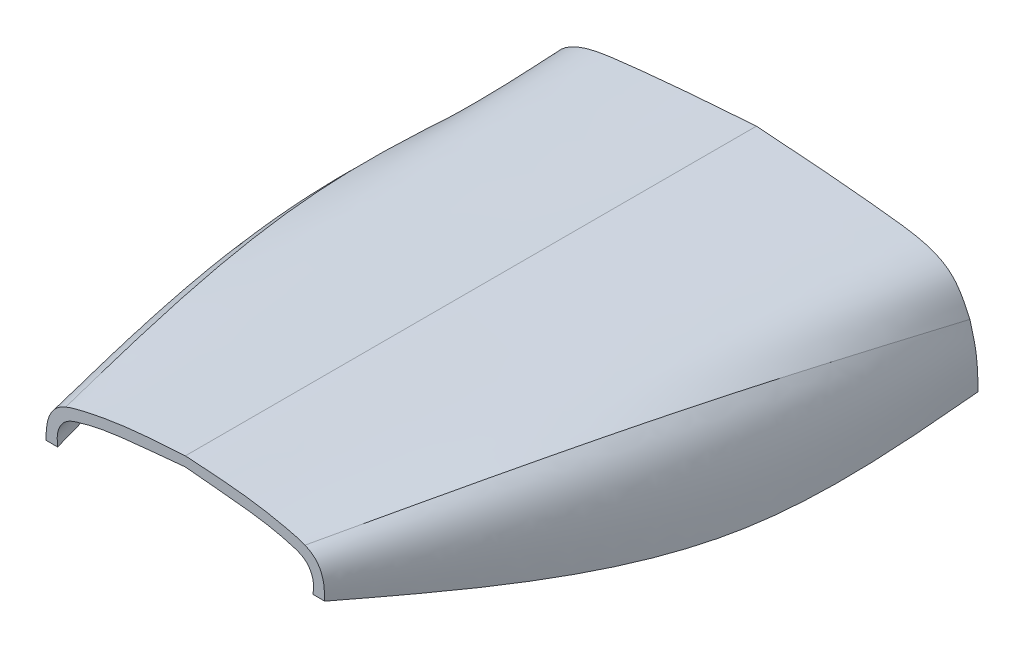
ISO-10303-21;
HEADER;
FILE_DESCRIPTION(('STEP AP214'),'2;1');
FILE_NAME('part.step','',(''),(''),'','','');
FILE_SCHEMA(('AUTOMOTIVE_DESIGN { 1 0 10303 214 1 1 1 1 }'));
ENDSEC;
DATA;
#1=APPLICATION_CONTEXT('core data for automotive mechanical design processes');
#2=APPLICATION_PROTOCOL_DEFINITION('international standard','automotive_design',2000,#1);
#3=PRODUCT_CONTEXT('',#1,'mechanical');
#4=PRODUCT('Part','Part','',(#3));
#5=PRODUCT_RELATED_PRODUCT_CATEGORY('part','',(#4));
#6=PRODUCT_DEFINITION_FORMATION('','',#4);
#7=PRODUCT_DEFINITION_CONTEXT('part definition',#1,'design');
#8=PRODUCT_DEFINITION('design','',#6,#7);
#9=PRODUCT_DEFINITION_SHAPE('','',#8);
#10=(LENGTH_UNIT() NAMED_UNIT(*) SI_UNIT(.MILLI.,.METRE.));
#11=(NAMED_UNIT(*) PLANE_ANGLE_UNIT() SI_UNIT($,.RADIAN.));
#12=(NAMED_UNIT(*) SI_UNIT($,.STERADIAN.) SOLID_ANGLE_UNIT());
#13=UNCERTAINTY_MEASURE_WITH_UNIT(LENGTH_MEASURE(1.E-05),#10,'distance_accuracy_value','');
#14=(GEOMETRIC_REPRESENTATION_CONTEXT(3) GLOBAL_UNCERTAINTY_ASSIGNED_CONTEXT((#13)) GLOBAL_UNIT_ASSIGNED_CONTEXT((#10,
#11,#12)) REPRESENTATION_CONTEXT('',''));
#15=CARTESIAN_POINT('',(0.,0.,0.));
#16=DIRECTION('',(0.,0.,1.));
#17=DIRECTION('',(1.,0.,0.));
#18=AXIS2_PLACEMENT_3D('',#15,#16,#17);
#19=CARTESIAN_POINT('',(-146.933411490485,-83.5884882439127,6.10622663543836E-13));
#20=CARTESIAN_POINT('',(-149.506193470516,-85.8345352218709,56.894503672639));
#21=CARTESIAN_POINT('',(-155.627695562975,-91.1786263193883,192.265408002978));
#22=CARTESIAN_POINT('',(-118.053943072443,-58.3766190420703,323.76680607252));
#23=CARTESIAN_POINT('',(-96.2719148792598,-39.3608380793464,400.));
#24=CARTESIAN_POINT('',(-147.165334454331,-78.1072746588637,-1.11022302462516E-13));
#25=CARTESIAN_POINT('',(-149.792983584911,-80.0009062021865,56.894503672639));
#26=CARTESIAN_POINT('',(-156.045032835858,-84.5064840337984,192.265408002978));
#27=CARTESIAN_POINT('',(-117.64179822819,-55.9281163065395,323.76680607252));
#28=CARTESIAN_POINT('',(-95.3789076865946,-39.3608380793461,400.));
#29=CARTESIAN_POINT('',(-147.404296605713,-72.4596985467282,-2.22044604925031E-13));
#30=CARTESIAN_POINT('',(-150.088478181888,-73.9902183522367,56.894503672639));
#31=CARTESIAN_POINT('',(-156.475036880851,-77.6318328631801,192.265408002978));
#32=CARTESIAN_POINT('',(-117.217144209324,-53.4052980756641,323.76680607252));
#33=CARTESIAN_POINT('',(-94.4587964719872,-39.360838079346,400.));
#34=CARTESIAN_POINT('',(-146.628028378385,-62.935038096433,-1.66533453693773E-13));
#35=CARTESIAN_POINT('',(-149.32737996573,-63.8471745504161,56.894503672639));
#36=CARTESIAN_POINT('',(-155.750033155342,-66.0174498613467,192.265408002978));
#37=CARTESIAN_POINT('',(-115.961300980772,-49.1431215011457,323.76680607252));
#38=CARTESIAN_POINT('',(-92.8952181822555,-39.3608380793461,400.));
#39=CARTESIAN_POINT('',(-145.863835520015,-58.5861047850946,4.44089209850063E-13));
#40=CARTESIAN_POINT('',(-148.550049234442,-59.214713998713,56.8945036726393));
#41=CARTESIAN_POINT('',(-154.94144306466,-60.7103839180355,192.265408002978));
#42=CARTESIAN_POINT('',(-115.210039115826,-47.1955662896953,323.76680607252));
#43=CARTESIAN_POINT('',(-92.1771902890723,-39.3608380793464,400.));
#44=CARTESIAN_POINT('',(-144.044001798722,-50.5128633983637,1.11022302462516E-13));
#45=CARTESIAN_POINT('',(-146.600473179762,-50.6428840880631,56.8945036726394));
#46=CARTESIAN_POINT('',(-152.68316694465,-50.9522464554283,192.265408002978));
#47=CARTESIAN_POINT('',(-113.526960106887,-43.6145835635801,323.76680607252));
#48=CARTESIAN_POINT('',(-90.8275610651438,-39.3608380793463,400.));
#49=CARTESIAN_POINT('',(-142.902789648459,-46.3449046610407,7.7715611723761E-13));
#50=CARTESIAN_POINT('',(-145.33807195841,-46.2288737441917,56.8945036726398));
#51=CARTESIAN_POINT('',(-151.132416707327,-45.9527976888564,192.265408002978));
#52=CARTESIAN_POINT('',(-112.510856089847,-41.7799158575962,323.76680607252));
#53=CARTESIAN_POINT('',(-90.1213989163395,-39.3608380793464,400.));
#54=CARTESIAN_POINT('',(-141.838271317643,-42.4570486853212,0.));
#55=CARTESIAN_POINT('',(-144.160508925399,-42.1115017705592,56.8945036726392));
#56=CARTESIAN_POINT('',(-149.685882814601,-41.2893309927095,192.265408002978));
#57=CARTESIAN_POINT('',(-111.563038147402,-40.0685448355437,323.76680607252));
#58=CARTESIAN_POINT('',(-89.4626935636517,-39.3608380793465,400.));
#59=B_SPLINE_SURFACE_WITH_KNOTS('',3,3,((#19,#20,#21,#22,#23),(#24,#25,#26,#27,#28),(#29,#30,
#31,#32,#33),(#34,#35,#36,#37,#38),(#39,#40,#41,#42,#43),(#44,#45,#46,#47,#48),(#49,#50,#51,#52,
#53),(#54,#55,#56,#57,#58)),.UNSPECIFIED.,.F.,.F.,.F.,(4,1,1,1,1,4),(4,1,4),(0.,
0.393440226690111,0.405381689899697,0.688879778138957,0.709788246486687,1.),(0.,
0.420286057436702,1.),.UNSPECIFIED.);
#60=CARTESIAN_POINT('',(-145.756926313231,-52.5000000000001,29.8162461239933));
#61=CARTESIAN_POINT('',(-145.76529993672,-52.4999984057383,30.0243207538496));
#62=CARTESIAN_POINT('',(-145.775768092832,-52.5086635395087,30.2322864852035));
#63=CARTESIAN_POINT('',(-145.800802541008,-52.5432097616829,30.6466038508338));
#64=CARTESIAN_POINT('',(-145.815369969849,-52.5690956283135,30.8529550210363));
#65=CARTESIAN_POINT('',(-145.848471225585,-52.6378645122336,31.2626747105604));
#66=CARTESIAN_POINT('',(-145.867008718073,-52.6807632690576,31.466040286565));
#67=CARTESIAN_POINT('',(-145.907855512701,-52.783184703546,31.8682341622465));
#68=CARTESIAN_POINT('',(-145.930166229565,-52.8427136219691,32.0670607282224));
#69=CARTESIAN_POINT('',(-145.978271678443,-52.9777496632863,32.4583589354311));
#70=CARTESIAN_POINT('',(-146.004059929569,-53.0532272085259,32.650841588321));
#71=CARTESIAN_POINT('',(-146.058885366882,-53.219635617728,33.0286089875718));
#72=CARTESIAN_POINT('',(-146.087923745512,-53.3105721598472,33.2138910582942));
#73=CARTESIAN_POINT('',(-146.148913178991,-53.5071063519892,33.5758632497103));
#74=CARTESIAN_POINT('',(-146.180862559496,-53.6126955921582,33.7525582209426));
#75=CARTESIAN_POINT('',(-146.247360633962,-53.8378184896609,34.0964054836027));
#76=CARTESIAN_POINT('',(-146.281910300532,-53.9573573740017,34.263554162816));
#77=CARTESIAN_POINT('',(-146.353883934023,-54.2117761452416,34.5901425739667));
#78=CARTESIAN_POINT('',(-146.391348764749,-54.3468956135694,34.7493866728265));
#79=CARTESIAN_POINT('',(-146.468194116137,-54.6297306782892,35.0558747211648));
#80=CARTESIAN_POINT('',(-146.507575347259,-54.7774509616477,35.2031141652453));
#81=CARTESIAN_POINT('',(-146.58780854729,-55.0843705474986,35.4845731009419));
#82=CARTESIAN_POINT('',(-146.628660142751,-55.2435669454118,35.6187958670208));
#83=CARTESIAN_POINT('',(-146.711431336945,-55.5724617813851,35.8734886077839));
#84=CARTESIAN_POINT('',(-146.75335141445,-55.7421649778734,35.9939522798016));
#85=CARTESIAN_POINT('',(-146.838910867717,-56.095418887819,36.2232525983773));
#86=CARTESIAN_POINT('',(-146.882566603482,-56.279214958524,36.3317053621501));
#87=CARTESIAN_POINT('',(-146.970047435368,-56.6552583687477,36.5325038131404));
#88=CARTESIAN_POINT('',(-147.013872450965,-56.847502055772,36.6248563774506));
#89=CARTESIAN_POINT('',(-147.101275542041,-57.2393007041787,36.7929214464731));
#90=CARTESIAN_POINT('',(-147.144853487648,-57.4388591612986,36.8686258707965));
#91=CARTESIAN_POINT('',(-147.231279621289,-57.84376413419,37.0027693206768));
#92=CARTESIAN_POINT('',(-147.274128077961,-58.0491084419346,37.0612148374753));
#93=CARTESIAN_POINT('',(-147.359086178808,-58.4662206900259,37.1608995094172));
#94=CARTESIAN_POINT('',(-147.40118500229,-58.6780310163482,37.2019706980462));
#95=CARTESIAN_POINT('',(-147.483792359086,-59.1046236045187,37.2657289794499));
#96=CARTESIAN_POINT('',(-147.52430148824,-59.3194047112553,37.2884230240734));
#97=CARTESIAN_POINT('',(-147.603378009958,-59.7505583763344,37.3152091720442));
#98=CARTESIAN_POINT('',(-147.641944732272,-59.9669314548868,37.3192948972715));
#99=CARTESIAN_POINT('',(-147.71676209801,-60.3995344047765,37.3087201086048));
#100=CARTESIAN_POINT('',(-147.753013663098,-60.6157642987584,37.2940671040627));
#101=CARTESIAN_POINT('',(-147.82249153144,-61.0439343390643,37.246322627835));
#102=CARTESIAN_POINT('',(-147.85574930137,-61.2558946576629,37.213457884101));
#103=CARTESIAN_POINT('',(-147.919475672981,-61.6765440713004,37.1296020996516));
#104=CARTESIAN_POINT('',(-147.949945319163,-61.8852343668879,37.0786178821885));
#105=CARTESIAN_POINT('',(-148.007923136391,-62.2978676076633,36.9587922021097));
#106=CARTESIAN_POINT('',(-148.035431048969,-62.5018101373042,36.8899491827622));
#107=CARTESIAN_POINT('',(-148.087348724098,-62.9033619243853,36.7348307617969));
#108=CARTESIAN_POINT('',(-148.111758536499,-63.1009712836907,36.6485556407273));
#109=CARTESIAN_POINT('',(-148.156916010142,-63.4841795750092,36.4611696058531));
#110=CARTESIAN_POINT('',(-148.177730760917,-63.6699448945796,36.3604149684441));
#111=CARTESIAN_POINT('',(-148.216300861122,-64.0325393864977,36.1434305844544));
#112=CARTESIAN_POINT('',(-148.234056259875,-64.209368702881,36.027201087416));
#113=CARTESIAN_POINT('',(-148.266536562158,-64.5527430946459,35.7800764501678));
#114=CARTESIAN_POINT('',(-148.281261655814,-64.7192888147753,35.6491822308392));
#115=CARTESIAN_POINT('',(-148.307757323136,-65.0408449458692,35.3736475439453));
#116=CARTESIAN_POINT('',(-148.319527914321,-65.1958554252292,35.2290071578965));
#117=CARTESIAN_POINT('',(-148.34008548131,-65.4911213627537,34.9290984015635));
#118=CARTESIAN_POINT('',(-148.348911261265,-65.6315504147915,34.7740035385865));
#119=CARTESIAN_POINT('',(-148.363940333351,-65.8990640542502,34.4524936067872));
#120=CARTESIAN_POINT('',(-148.370142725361,-66.0261440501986,34.2860746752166));
#121=CARTESIAN_POINT('',(-148.380078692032,-66.265932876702,33.9432102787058));
#122=CARTESIAN_POINT('',(-148.383813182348,-66.3786470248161,33.7667685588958));
#123=CARTESIAN_POINT('',(-148.388990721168,-66.588984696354,33.4049894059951));
#124=CARTESIAN_POINT('',(-148.390432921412,-66.6866026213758,33.2196487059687));
#125=CARTESIAN_POINT('',(-148.391199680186,-66.8658284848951,32.8418101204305));
#126=CARTESIAN_POINT('',(-148.390528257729,-66.9474664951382,32.6493265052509));
#127=CARTESIAN_POINT('',(-148.387248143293,-67.0944149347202,32.2581601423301));
#128=CARTESIAN_POINT('',(-148.384638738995,-67.1597193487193,32.059475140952));
#129=CARTESIAN_POINT('',(-148.377643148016,-67.2734962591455,31.6574126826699));
#130=CARTESIAN_POINT('',(-148.373257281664,-67.3219717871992,31.4540360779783));
#131=CARTESIAN_POINT('',(-148.362851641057,-67.4017761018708,31.0439837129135));
#132=CARTESIAN_POINT('',(-148.356831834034,-67.4331045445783,30.8373078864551));
#133=CARTESIAN_POINT('',(-148.34324974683,-67.4784965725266,30.421269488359));
#134=CARTESIAN_POINT('',(-148.335681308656,-67.4924896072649,30.2118994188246));
#135=CARTESIAN_POINT('',(-148.319109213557,-67.5028923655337,29.7927748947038));
#136=CARTESIAN_POINT('',(-148.310105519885,-67.4993016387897,29.5830204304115));
#137=CARTESIAN_POINT('',(-148.290727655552,-67.4745785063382,29.1646478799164));
#138=CARTESIAN_POINT('',(-148.280353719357,-67.453449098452,28.9560296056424));
#139=CARTESIAN_POINT('',(-148.258263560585,-67.3938079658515,28.5412910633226));
#140=CARTESIAN_POINT('',(-148.246546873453,-67.3552902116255,28.3351716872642));
#141=CARTESIAN_POINT('',(-148.221733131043,-67.2609911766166,27.9262200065));
#142=CARTESIAN_POINT('',(-148.208631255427,-67.2051482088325,27.7234022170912));
#143=CARTESIAN_POINT('',(-148.181053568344,-67.0766389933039,27.3231817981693));
#144=CARTESIAN_POINT('',(-148.166577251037,-67.003966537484,27.1257811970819));
#145=CARTESIAN_POINT('',(-148.13621262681,-66.8423650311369,26.7379068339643));
#146=CARTESIAN_POINT('',(-148.120324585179,-66.7534390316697,26.5474317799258));
#147=CARTESIAN_POINT('',(-148.087072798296,-66.559978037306,26.1747112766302));
#148=CARTESIAN_POINT('',(-148.06970902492,-66.4554427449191,25.9924659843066));
#149=CARTESIAN_POINT('',(-148.033381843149,-66.2312025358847,25.6369623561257));
#150=CARTESIAN_POINT('',(-148.014413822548,-66.1114533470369,25.463732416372));
#151=CARTESIAN_POINT('',(-147.974850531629,-65.8579157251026,25.1280627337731));
#152=CARTESIAN_POINT('',(-147.95425522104,-65.7241269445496,24.9656232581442));
#153=CARTESIAN_POINT('',(-147.911376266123,-65.4435265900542,24.6527032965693));
#154=CARTESIAN_POINT('',(-147.889092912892,-65.2967172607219,24.5022207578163));
#155=CARTESIAN_POINT('',(-147.84277694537,-64.9910886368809,24.2141801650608));
#156=CARTESIAN_POINT('',(-147.818743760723,-64.8322654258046,24.0766263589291));
#157=CARTESIAN_POINT('',(-147.768816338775,-64.5032225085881,23.814968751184));
#158=CARTESIAN_POINT('',(-147.74291568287,-64.332963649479,23.6909154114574));
#159=CARTESIAN_POINT('',(-147.689331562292,-63.9828157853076,23.4576747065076));
#160=CARTESIAN_POINT('',(-147.661648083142,-63.8029267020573,23.3484874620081));
#161=CARTESIAN_POINT('',(-147.604529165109,-63.4347977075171,23.1456888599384));
#162=CARTESIAN_POINT('',(-147.575093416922,-63.2465563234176,23.0520802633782));
#163=CARTESIAN_POINT('',(-147.514558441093,-62.8631714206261,22.8810971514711));
#164=CARTESIAN_POINT('',(-147.483459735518,-62.668030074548,22.8037175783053));
#165=CARTESIAN_POINT('',(-147.419463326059,-62.2706755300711,22.6651173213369));
#166=CARTESIAN_POINT('',(-147.38655375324,-62.0684198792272,22.604023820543));
#167=CARTESIAN_POINT('',(-147.319315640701,-61.6597056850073,22.4991504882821));
#168=CARTESIAN_POINT('',(-147.284987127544,-61.4532472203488,22.4553703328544));
#169=CARTESIAN_POINT('',(-147.21511066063,-61.0375624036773,22.3853719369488));
#170=CARTESIAN_POINT('',(-147.179562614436,-60.828335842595,22.3591550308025));
#171=CARTESIAN_POINT('',(-147.107492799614,-60.4085880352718,22.3244235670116));
#172=CARTESIAN_POINT('',(-147.070971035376,-60.1980667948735,22.3159089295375));
#173=CARTESIAN_POINT('',(-146.996817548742,-59.7748040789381,22.3166076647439));
#174=CARTESIAN_POINT('',(-146.959177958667,-59.5620642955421,22.326021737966));
#175=CARTESIAN_POINT('',(-146.883525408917,-59.1382992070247,22.3628784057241));
#176=CARTESIAN_POINT('',(-146.845512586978,-58.9272733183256,22.3903145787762));
#177=CARTESIAN_POINT('',(-146.769435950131,-58.5082305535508,22.4630247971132));
#178=CARTESIAN_POINT('',(-146.731372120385,-58.3002149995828,22.5083064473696));
#179=CARTESIAN_POINT('',(-146.655600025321,-57.888801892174,22.6163807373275));
#180=CARTESIAN_POINT('',(-146.617891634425,-57.6854026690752,22.6791669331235));
#181=CARTESIAN_POINT('',(-146.542939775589,-57.2831047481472,22.8223633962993));
#182=CARTESIAN_POINT('',(-146.505701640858,-57.0842492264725,22.9028978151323));
#183=CARTESIAN_POINT('',(-146.432400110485,-56.6940636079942,23.0807626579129));
#184=CARTESIAN_POINT('',(-146.396336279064,-56.5027307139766,23.1780867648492));
#185=CARTESIAN_POINT('',(-146.325777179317,-56.1288256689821,23.3889533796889));
#186=CARTESIAN_POINT('',(-146.291282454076,-55.9462565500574,23.5025014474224));
#187=CARTESIAN_POINT('',(-146.224308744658,-55.5913610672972,23.7449964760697));
#188=CARTESIAN_POINT('',(-146.191828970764,-55.4190306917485,23.8739373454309));
#189=CARTESIAN_POINT('',(-146.12952105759,-55.0870966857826,24.1453561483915));
#190=CARTESIAN_POINT('',(-146.099674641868,-54.9274062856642,24.2877237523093));
#191=CARTESIAN_POINT('',(-146.042762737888,-54.620579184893,24.5858005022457));
#192=CARTESIAN_POINT('',(-146.015696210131,-54.4734377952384,24.7415046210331));
#193=CARTESIAN_POINT('',(-145.964693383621,-54.192738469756,25.0652846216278));
#194=CARTESIAN_POINT('',(-145.940758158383,-54.0591851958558,25.2333647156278));
#195=CARTESIAN_POINT('',(-145.896370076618,-53.8067890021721,25.5806572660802));
#196=CARTESIAN_POINT('',(-145.875917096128,-53.6879455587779,25.759869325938));
#197=CARTESIAN_POINT('',(-145.83920149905,-53.4683557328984,26.1241117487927));
#198=CARTESIAN_POINT('',(-145.822857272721,-53.3672713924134,26.3089301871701));
#199=CARTESIAN_POINT('',(-145.794035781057,-53.1809083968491,26.686655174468));
#200=CARTESIAN_POINT('',(-145.781558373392,-53.0956291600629,26.879561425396));
#201=CARTESIAN_POINT('',(-145.760681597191,-52.9416500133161,27.271833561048));
#202=CARTESIAN_POINT('',(-145.752277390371,-52.8729304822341,27.4711914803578));
#203=CARTESIAN_POINT('',(-145.73967478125,-52.7525100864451,27.8750388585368));
#204=CARTESIAN_POINT('',(-145.735475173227,-52.7008043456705,28.0795268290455));
#205=CARTESIAN_POINT('',(-145.730925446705,-52.6053795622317,28.5373585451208));
#206=CARTESIAN_POINT('',(-145.731618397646,-52.5658820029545,28.791604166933));
#207=CARTESIAN_POINT('',(-145.739453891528,-52.5131934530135,29.3027038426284));
#208=CARTESIAN_POINT('',(-145.746596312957,-52.5000019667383,29.5595578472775));
#209=CARTESIAN_POINT('',(-145.756926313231,-52.5000000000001,29.8162461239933));
#210=B_SPLINE_CURVE_WITH_KNOTS('',3,(#60,#61,#62,#63,#64,#65,#66,#67,#68,#69,#70,#71,#72,#73,
#74,#75,#76,#77,#78,#79,#80,#81,#82,#83,#84,#85,#86,#87,#88,#89,#90,#91,#92,#93,#94,#95,#96,#97,
#98,#99,#100,#101,#102,#103,#104,#105,#106,#107,#108,#109,#110,#111,#112,#113,#114,#115,#116,
#117,#118,#119,#120,#121,#122,#123,#124,#125,#126,#127,#128,#129,#130,#131,#132,#133,#134,#135,
#136,#137,#138,#139,#140,#141,#142,#143,#144,#145,#146,#147,#148,#149,#150,#151,#152,#153,#154,
#155,#156,#157,#158,#159,#160,#161,#162,#163,#164,#165,#166,#167,#168,#169,#170,#171,#172,#173,
#174,#175,#176,#177,#178,#179,#180,#181,#182,#183,#184,#185,#186,#187,#188,#189,#190,#191,#192,
#193,#194,#195,#196,#197,#198,#199,#200,#201,#202,#203,#204,#205,#206,#207,#208,#209),
.UNSPECIFIED.,.T.,.F.,(4,2,2,2,2,2,2,2,2,2,2,2,2,2,2,2,2,2,2,2,2,2,2,2,2,2,2,2,2,2,2,2,2,2,2,2,
2,2,2,2,2,2,2,2,2,2,2,2,2,2,2,2,2,2,2,2,2,2,2,2,2,2,2,2,2,2,2,2,2,2,2,2,2,2,4),(0.,
0.624497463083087,1.24916827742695,1.87441836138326,2.49990339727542,3.12423845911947,
3.74880333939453,4.37301122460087,4.99745375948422,5.63325951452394,6.26930280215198,
6.90518567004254,7.54135866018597,8.19407736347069,8.84651657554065,9.49927176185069,
10.1517811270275,10.8104619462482,11.4688934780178,12.1275506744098,12.7859440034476,
13.4363190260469,14.0864493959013,14.7366364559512,15.3868130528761,16.0231011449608,
16.6593789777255,17.2956168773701,17.9318510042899,18.5593357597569,19.1870356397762,
19.8145024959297,20.4422014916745,21.0687076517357,21.69544420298,22.322067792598,
22.9487039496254,23.5778820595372,24.2070762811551,24.8361629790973,25.4654679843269,
26.0970398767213,26.7288451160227,27.3605318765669,27.9922306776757,28.625811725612,
29.2594084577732,29.8928961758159,30.5265913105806,31.1625791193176,31.7985720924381,
32.4346776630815,33.0705846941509,33.7113211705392,34.3520456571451,34.9928188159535,
35.6335890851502,36.2815745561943,36.929329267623,37.5773603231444,38.2251531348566,
38.8776299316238,39.5298617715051,40.182317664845,40.8345162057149,41.4817580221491,
42.1287569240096,42.775977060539,43.4231741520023,44.0562662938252,44.6893351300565,
45.3216501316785,45.9537837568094,46.7242005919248,47.4946029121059),.UNSPECIFIED.);
#211=CARTESIAN_POINT('',(-145.756926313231,-52.5000000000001,29.8162461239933));
#212=VERTEX_POINT('',#211);
#213=EDGE_CURVE('E11',#212,#212,#210,.T.);
#214=CARTESIAN_POINT('',(-141.838271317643,-42.4570486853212,0.));
#215=CARTESIAN_POINT('',(-144.160508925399,-42.1115017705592,56.8945036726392));
#216=CARTESIAN_POINT('',(-149.685882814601,-41.2893309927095,192.265408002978));
#217=CARTESIAN_POINT('',(-111.563038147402,-40.0685448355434,323.76680607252));
#218=CARTESIAN_POINT('',(-89.4626935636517,-39.3608380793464,400.));
#219=B_SPLINE_CURVE_WITH_KNOTS('',3,(#214,#215,#216,#217,#218),.UNSPECIFIED.,.F.,.F.,(4,1,4),
(0.,0.420286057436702,1.),.UNSPECIFIED.);
#220=CARTESIAN_POINT('',(-111.706844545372,-40.0868840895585,321.147883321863));
#221=VERTEX_POINT('',#220);
#222=CARTESIAN_POINT('',(-141.838271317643,-42.4570486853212,0.));
#223=VERTEX_POINT('',#222);
#224=EDGE_CURVE('E388',#221,#223,#219,.F.);
#225=CARTESIAN_POINT('',(-111.706844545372,-40.0868840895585,321.147883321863));
#226=CARTESIAN_POINT('',(-111.82022967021,-40.2940704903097,321.150286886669));
#227=CARTESIAN_POINT('',(-111.931879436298,-40.5021726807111,321.161282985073));
#228=CARTESIAN_POINT('',(-112.150707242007,-40.9192471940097,321.200976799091));
#229=CARTESIAN_POINT('',(-112.257881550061,-41.128220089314,321.229688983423));
#230=CARTESIAN_POINT('',(-112.467478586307,-41.5475529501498,321.305659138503));
#231=CARTESIAN_POINT('',(-112.569851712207,-41.7579091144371,321.353076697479));
#232=CARTESIAN_POINT('',(-112.767597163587,-42.1767420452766,321.466928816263));
#233=CARTESIAN_POINT('',(-112.862970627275,-42.3852191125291,321.533360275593));
#234=CARTESIAN_POINT('',(-113.045970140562,-42.799840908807,321.686061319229));
#235=CARTESIAN_POINT('',(-113.133550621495,-43.0059664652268,321.772438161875));
#236=CARTESIAN_POINT('',(-113.299076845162,-43.4127981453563,321.965055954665));
#237=CARTESIAN_POINT('',(-113.37702181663,-43.6135038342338,322.071298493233));
#238=CARTESIAN_POINT('',(-113.521749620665,-44.0065254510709,322.303122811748));
#239=CARTESIAN_POINT('',(-113.588574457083,-44.1988708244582,322.428628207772));
#240=CARTESIAN_POINT('',(-113.710338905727,-44.5735958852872,322.698805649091));
#241=CARTESIAN_POINT('',(-113.765281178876,-44.7559777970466,322.843473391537));
#242=CARTESIAN_POINT('',(-113.855661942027,-45.0836342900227,323.129489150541));
#243=CARTESIAN_POINT('',(-113.892754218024,-45.2305287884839,323.268465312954));
#244=CARTESIAN_POINT('',(-113.957212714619,-45.5135950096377,323.559021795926));
#245=CARTESIAN_POINT('',(-113.984579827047,-45.6497677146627,323.710600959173));
#246=CARTESIAN_POINT('',(-114.029569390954,-45.9099833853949,324.025280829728));
#247=CARTESIAN_POINT('',(-114.047188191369,-46.0340217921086,324.188385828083));
#248=CARTESIAN_POINT('',(-114.072828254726,-46.2686282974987,324.524719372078));
#249=CARTESIAN_POINT('',(-114.080849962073,-46.3791970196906,324.697947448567));
#250=CARTESIAN_POINT('',(-114.087246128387,-46.5754845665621,325.035288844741));
#251=CARTESIAN_POINT('',(-114.086503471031,-46.6625821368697,325.198586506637));
#252=CARTESIAN_POINT('',(-114.077755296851,-46.8244276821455,325.531071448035));
#253=CARTESIAN_POINT('',(-114.069747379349,-46.8991715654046,325.700260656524));
#254=CARTESIAN_POINT('',(-114.046803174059,-47.0357778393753,326.043176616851));
#255=CARTESIAN_POINT('',(-114.031871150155,-47.0976481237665,326.216900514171));
#256=CARTESIAN_POINT('',(-113.995434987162,-47.2082920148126,326.567862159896));
#257=CARTESIAN_POINT('',(-113.973928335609,-47.2570606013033,326.745101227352));
#258=CARTESIAN_POINT('',(-113.924255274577,-47.342111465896,327.105215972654));
#259=CARTESIAN_POINT('',(-113.895971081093,-47.3781413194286,327.288134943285));
#260=CARTESIAN_POINT('',(-113.833350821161,-47.4364062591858,327.65520429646));
#261=CARTESIAN_POINT('',(-113.799012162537,-47.4586354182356,327.839355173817));
#262=CARTESIAN_POINT('',(-113.724669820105,-47.4893775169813,328.207643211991));
#263=CARTESIAN_POINT('',(-113.68466638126,-47.4978910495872,328.391780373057));
#264=CARTESIAN_POINT('',(-113.599343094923,-47.5014174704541,328.758952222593));
#265=CARTESIAN_POINT('',(-113.554022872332,-47.4964294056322,328.94198683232));
#266=CARTESIAN_POINT('',(-113.45510000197,-47.4724618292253,329.318408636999));
#267=CARTESIAN_POINT('',(-113.401142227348,-47.4525445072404,329.511643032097));
#268=CARTESIAN_POINT('',(-113.287887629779,-47.3981295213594,329.894391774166));
#269=CARTESIAN_POINT('',(-113.228592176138,-47.3636355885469,330.083907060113));
#270=CARTESIAN_POINT('',(-113.104923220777,-47.2806253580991,330.458255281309));
#271=CARTESIAN_POINT('',(-113.040547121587,-47.2321018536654,330.643085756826));
#272=CARTESIAN_POINT('',(-112.90702930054,-47.1217183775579,331.006883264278));
#273=CARTESIAN_POINT('',(-112.837888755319,-47.0598616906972,331.185851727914));
#274=CARTESIAN_POINT('',(-112.689118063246,-46.9178652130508,331.551646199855));
#275=CARTESIAN_POINT('',(-112.609093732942,-46.8366328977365,331.737888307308));
#276=CARTESIAN_POINT('',(-112.443972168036,-46.6603827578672,332.101378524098));
#277=CARTESIAN_POINT('',(-112.358874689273,-46.5653642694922,332.278626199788));
#278=CARTESIAN_POINT('',(-112.183840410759,-46.3626131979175,332.623196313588));
#279=CARTESIAN_POINT('',(-112.093903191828,-46.2548795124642,332.790517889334));
#280=CARTESIAN_POINT('',(-111.909421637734,-46.0278270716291,333.114417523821));
#281=CARTESIAN_POINT('',(-111.814876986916,-45.9085075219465,333.270994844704));
#282=CARTESIAN_POINT('',(-111.612752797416,-45.648296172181,333.586222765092));
#283=CARTESIAN_POINT('',(-111.504763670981,-45.5064294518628,333.743806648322));
#284=CARTESIAN_POINT('',(-111.283894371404,-45.2118160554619,334.044723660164));
#285=CARTESIAN_POINT('',(-111.171013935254,-45.0590687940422,334.188056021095));
#286=CARTESIAN_POINT('',(-110.940605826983,-44.7440988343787,334.460025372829));
#287=CARTESIAN_POINT('',(-110.823075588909,-44.5818708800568,334.588654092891));
#288=CARTESIAN_POINT('',(-110.583853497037,-44.2494223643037,334.830802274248));
#289=CARTESIAN_POINT('',(-110.462161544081,-44.0792016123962,334.944321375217));
#290=CARTESIAN_POINT('',(-110.202237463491,-43.7137139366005,335.167260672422));
#291=CARTESIAN_POINT('',(-110.063612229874,-43.5176961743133,335.274992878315));
#292=CARTESIAN_POINT('',(-109.782962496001,-43.1188186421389,335.471780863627));
#293=CARTESIAN_POINT('',(-109.640937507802,-42.9159578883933,335.560833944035));
#294=CARTESIAN_POINT('',(-109.354608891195,-42.5046568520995,335.720238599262));
#295=CARTESIAN_POINT('',(-109.210305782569,-42.2962178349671,335.790594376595));
#296=CARTESIAN_POINT('',(-108.920635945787,-41.8747638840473,335.912597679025));
#297=CARTESIAN_POINT('',(-108.77526948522,-41.6617500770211,335.964249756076));
#298=CARTESIAN_POINT('',(-108.464190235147,-41.2014560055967,336.054742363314));
#299=CARTESIAN_POINT('',(-108.298504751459,-40.9535867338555,336.090741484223));
#300=CARTESIAN_POINT('',(-108.052079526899,-40.5791458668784,336.126033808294));
#301=CARTESIAN_POINT('',(-107.970372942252,-40.4540254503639,336.134680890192));
#302=CARTESIAN_POINT('',(-107.807867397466,-40.2028806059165,336.14568811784));
#303=CARTESIAN_POINT('',(-107.727068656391,-40.0768559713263,336.148046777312));
#304=CARTESIAN_POINT('',(-107.6468765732,-39.9504378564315,336.14721628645));
#305=B_SPLINE_CURVE_WITH_KNOTS('',3,(#225,#226,#227,#228,#229,#230,#231,#232,#233,#234,#235,
#236,#237,#238,#239,#240,#241,#242,#243,#244,#245,#246,#247,#248,#249,#250,#251,#252,#253,#254,
#255,#256,#257,#258,#259,#260,#261,#262,#263,#264,#265,#266,#267,#268,#269,#270,#271,#272,#273,
#274,#275,#276,#277,#278,#279,#280,#281,#282,#283,#284,#285,#286,#287,#288,#289,#290,#291,#292,
#293,#294,#295,#296,#297,#298,#299,#300,#301,#302,#303,#304),.UNSPECIFIED.,.F.,.F.,(4,2,2,2,2,2,
2,2,2,2,2,2,2,2,2,2,2,2,2,2,2,2,2,2,2,2,2,2,2,2,2,2,2,2,2,2,2,2,2,4),(0.,0.708507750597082,
1.41759490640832,2.13286735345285,2.84802323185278,3.56711838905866,4.28627106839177,
5.00264241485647,5.71885317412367,6.33477270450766,6.95063573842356,7.56672927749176,
8.18279428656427,8.73737717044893,9.29214337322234,9.84656840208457,10.4012055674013,
10.966287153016,11.5316112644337,12.0969109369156,12.6622505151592,13.2664348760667,
13.8704646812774,14.4748053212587,15.0789972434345,15.7334244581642,16.3878831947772,
17.0423987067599,17.6969591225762,18.4100535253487,19.1231863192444,19.8367182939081,
20.5502672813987,21.3388934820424,22.1276335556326,22.9161961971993,23.7045667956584,
24.6043303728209,25.0532707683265,25.5023172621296),.UNSPECIFIED.);
#306=CARTESIAN_POINT('',(-107.6468765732,-39.9504378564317,336.14721628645));
#307=VERTEX_POINT('',#306);
#308=EDGE_CURVE('E36',#221,#307,#305,.T.);
#309=CARTESIAN_POINT('',(-89.4626935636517,-39.3608380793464,400.));
#310=VERTEX_POINT('',#309);
#311=EDGE_CURVE('E298',#310,#307,#219,.F.);
#312=DIRECTION('',(0.999999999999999,0.,0.));
#313=VECTOR('',#312,1.);
#314=CARTESIAN_POINT('',(-97.6103457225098,-39.3608380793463,400.));
#315=LINE('',#314,#313);
#316=CARTESIAN_POINT('',(-96.2719148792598,-39.3608380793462,400.));
#317=VERTEX_POINT('',#316);
#318=EDGE_CURVE('E481',#317,#310,#315,.T.);
#319=CARTESIAN_POINT('',(-146.933411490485,-83.5884882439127,6.10622663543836E-13));
#320=CARTESIAN_POINT('',(-149.506193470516,-85.8345352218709,56.894503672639));
#321=CARTESIAN_POINT('',(-155.627695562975,-91.1786263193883,192.265408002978));
#322=CARTESIAN_POINT('',(-118.053943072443,-58.3766190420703,323.76680607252));
#323=CARTESIAN_POINT('',(-96.2719148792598,-39.3608380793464,400.));
#324=B_SPLINE_CURVE_WITH_KNOTS('',3,(#319,#320,#321,#322,#323),.UNSPECIFIED.,.F.,.F.,(4,1,4),
(0.,0.420286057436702,1.),.UNSPECIFIED.);
#325=CARTESIAN_POINT('',(-146.933411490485,-83.5884882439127,6.10622663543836E-13));
#326=VERTEX_POINT('',#325);
#327=EDGE_CURVE('E391',#317,#326,#324,.F.);
#328=CARTESIAN_POINT('',(-146.933411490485,-83.5884882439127,6.10622663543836E-13));
#329=CARTESIAN_POINT('',(-147.172373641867,-77.9409121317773,0.));
#330=CARTESIAN_POINT('',(-147.590775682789,-68.0524952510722,0.));
#331=CARTESIAN_POINT('',(-145.083893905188,-54.3107789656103,6.10622663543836E-13));
#332=CARTESIAN_POINT('',(-142.902789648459,-46.3449046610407,7.7715611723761E-13));
#333=CARTESIAN_POINT('',(-141.838271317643,-42.4570486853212,0.));
#334=B_SPLINE_CURVE_WITH_KNOTS('',3,(#328,#329,#330,#331,#332,#333),.UNSPECIFIED.,.F.,.F.,(4,1,
1,4),(0.,0.405381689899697,0.709788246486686,1.),.UNSPECIFIED.);
#335=EDGE_CURVE('E354',#326,#223,#334,.T.);
#336=ORIENTED_EDGE('',*,*,#213,.F.);
#337=EDGE_LOOP('',(#336));
#338=FACE_BOUND('',#337,.T.);
#339=ORIENTED_EDGE('',*,*,#224,.F.);
#340=ORIENTED_EDGE('',*,*,#308,.T.);
#341=ORIENTED_EDGE('',*,*,#311,.F.);
#342=ORIENTED_EDGE('',*,*,#318,.F.);
#343=ORIENTED_EDGE('',*,*,#327,.T.);
#344=ORIENTED_EDGE('',*,*,#335,.T.);
#345=EDGE_LOOP('',(#339,#340,#341,#342,#343,#344));
#346=FACE_BOUND('',#345,.T.);
#347=ADVANCED_FACE('F32',(#338,#346),#59,.T.);
#348=CARTESIAN_POINT('',(-57.8433842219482,-5.82504994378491,400.));
#349=DIRECTION('',(0.,0.,0.999999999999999));
#350=DIRECTION('',(0.999999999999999,0.,0.));
#351=AXIS2_PLACEMENT_3D('',#348,#349,#350);
#352=PLANE('',#351);
#353=CARTESIAN_POINT('',(0.,-2.22044604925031E-13,400.));
#354=CARTESIAN_POINT('',(-24.7299028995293,-1.50590614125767,400.));
#355=CARTESIAN_POINT('',(-55.3612817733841,-3.37117757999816,400.));
#356=CARTESIAN_POINT('',(-90.4306536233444,-13.8708027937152,400.));
#357=CARTESIAN_POINT('',(-97.3642685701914,-26.7222303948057,399.999999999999));
#358=CARTESIAN_POINT('',(-97.5180896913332,-34.622536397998,400.));
#359=CARTESIAN_POINT('',(-97.6103457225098,-39.3608380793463,400.));
#360=B_SPLINE_CURVE_WITH_KNOTS('',3,(#353,#354,#355,#356,#357,#358,#359),.UNSPECIFIED.,.F.,.F.,
(4,1,1,1,4),(0.,0.645488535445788,0.799526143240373,0.879763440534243,1.),.UNSPECIFIED.);
#361=CARTESIAN_POINT('',(0.,-2.22044604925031E-13,400.));
#362=VERTEX_POINT('',#361);
#363=CARTESIAN_POINT('',(-83.7913827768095,-12.2870856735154,400.));
#364=VERTEX_POINT('',#363);
#365=EDGE_CURVE('E428',#362,#364,#360,.T.);
#366=ORIENTED_EDGE('',*,*,#365,.T.);
#367=CARTESIAN_POINT('',(-97.6103457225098,-39.3608380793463,400.));
#368=VERTEX_POINT('',#367);
#369=EDGE_CURVE('E430',#364,#368,#360,.T.);
#370=ORIENTED_EDGE('',*,*,#369,.T.);
#371=EDGE_CURVE('E448',#368,#317,#315,.T.);
#372=ORIENTED_EDGE('',*,*,#371,.T.);
#373=ORIENTED_EDGE('',*,*,#318,.T.);
#374=CARTESIAN_POINT('',(-89.4626935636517,-39.3608380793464,400.));
#375=CARTESIAN_POINT('',(-89.7354858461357,-36.4703281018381,400.));
#376=CARTESIAN_POINT('',(-90.3135169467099,-30.0833772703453,399.999999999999));
#377=CARTESIAN_POINT('',(-85.1248942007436,-20.5753972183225,399.999999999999));
#378=CARTESIAN_POINT('',(-63.1300868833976,-12.9494024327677,400.));
#379=CARTESIAN_POINT('',(-34.7948399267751,-10.0590475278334,399.999999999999));
#380=CARTESIAN_POINT('',(-9.62459815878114,-7.674526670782,400.));
#381=CARTESIAN_POINT('',(0.,-6.7627334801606,399.999999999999));
#382=B_SPLINE_CURVE_WITH_KNOTS('',3,(#374,#375,#376,#377,#378,#379,#380,#381),.UNSPECIFIED.,.F.,
.F.,(4,1,1,1,1,4),(0.,0.0819381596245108,0.18109195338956,0.279151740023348,0.723646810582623,
0.998842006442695),.UNSPECIFIED.);
#383=CARTESIAN_POINT('',(0.,-6.7627334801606,399.999999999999));
#384=VERTEX_POINT('',#383);
#385=EDGE_CURVE('E431',#310,#384,#382,.T.);
#386=ORIENTED_EDGE('',*,*,#385,.T.);
#387=CARTESIAN_POINT('',(89.4626935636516,-39.3608380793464,400.));
#388=CARTESIAN_POINT('',(89.7354858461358,-36.4703281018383,400.));
#389=CARTESIAN_POINT('',(90.3135169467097,-30.0833772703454,400.));
#390=CARTESIAN_POINT('',(85.1248942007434,-20.5753972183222,400.));
#391=CARTESIAN_POINT('',(63.1300868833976,-12.949402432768,400.));
#392=CARTESIAN_POINT('',(34.7948399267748,-10.0590475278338,400.));
#393=CARTESIAN_POINT('',(9.62459815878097,-7.67452667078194,400.));
#394=CARTESIAN_POINT('',(0.,-6.7627334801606,399.999999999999));
#395=B_SPLINE_CURVE_WITH_KNOTS('',3,(#387,#388,#389,#390,#391,#392,#393,#394),.UNSPECIFIED.,.F.,
.F.,(4,1,1,1,1,4),(0.,0.0819381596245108,0.18109195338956,0.279151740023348,0.723646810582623,
0.998842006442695),.UNSPECIFIED.);
#396=CARTESIAN_POINT('',(89.4626935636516,-39.3608380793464,400.));
#397=VERTEX_POINT('',#396);
#398=EDGE_CURVE('E395',#397,#384,#395,.T.);
#399=ORIENTED_EDGE('',*,*,#398,.F.);
#400=DIRECTION('',(-0.999999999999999,0.,0.));
#401=VECTOR('',#400,1.);
#402=CARTESIAN_POINT('',(97.6103457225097,-39.3608380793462,399.999999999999));
#403=LINE('',#402,#401);
#404=CARTESIAN_POINT('',(96.2719148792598,-39.3608380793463,400.));
#405=VERTEX_POINT('',#404);
#406=EDGE_CURVE('E398',#405,#397,#403,.T.);
#407=ORIENTED_EDGE('',*,*,#406,.F.);
#408=CARTESIAN_POINT('',(97.6103457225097,-39.3608380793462,399.999999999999));
#409=VERTEX_POINT('',#408);
#410=EDGE_CURVE('E401',#409,#405,#403,.T.);
#411=ORIENTED_EDGE('',*,*,#410,.F.);
#412=CARTESIAN_POINT('',(0.,-2.22044604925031E-13,400.));
#413=CARTESIAN_POINT('',(24.7299028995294,-1.50590614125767,400.));
#414=CARTESIAN_POINT('',(55.3612817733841,-3.37117757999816,400.));
#415=CARTESIAN_POINT('',(90.4306536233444,-13.8708027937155,400.));
#416=CARTESIAN_POINT('',(97.3642685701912,-26.7222303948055,399.999999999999));
#417=CARTESIAN_POINT('',(97.5180896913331,-34.6225363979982,400.));
#418=CARTESIAN_POINT('',(97.6103457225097,-39.3608380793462,399.999999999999));
#419=B_SPLINE_CURVE_WITH_KNOTS('',3,(#412,#413,#414,#415,#416,#417,#418),.UNSPECIFIED.,.F.,.F.,
(4,1,1,1,4),(0.,0.645488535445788,0.799526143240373,0.879763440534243,1.),.UNSPECIFIED.);
#420=CARTESIAN_POINT('',(83.7913827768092,-12.2870856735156,400.));
#421=VERTEX_POINT('',#420);
#422=EDGE_CURVE('E139',#421,#409,#419,.T.);
#423=ORIENTED_EDGE('',*,*,#422,.F.);
#424=EDGE_CURVE('E399',#362,#421,#419,.T.);
#425=ORIENTED_EDGE('',*,*,#424,.F.);
#426=EDGE_LOOP('',(#366,#370,#372,#373,#386,#399,#407,#411,#423,#425));
#427=FACE_BOUND('',#426,.T.);
#428=ADVANCED_FACE('F286',(#427),#352,.T.);
#429=CARTESIAN_POINT('',(-80.7051063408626,-6.65923305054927,0.));
#430=DIRECTION('',(0.,0.,0.999999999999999));
#431=DIRECTION('',(0.999999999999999,0.,0.));
#432=AXIS2_PLACEMENT_3D('',#429,#430,#431);
#433=PLANE('',#432);
#434=CARTESIAN_POINT('',(-3.33066907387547E-13,1.11022302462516E-13,-1.11022302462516E-13));
#435=CARTESIAN_POINT('',(-30.462821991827,-2.14215237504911,-2.77555756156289E-13));
#436=CARTESIAN_POINT('',(-75.4533051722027,-5.30589309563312,2.22044604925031E-13));
#437=CARTESIAN_POINT('',(-136.14449240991,-13.49987690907,0.));
#438=CARTESIAN_POINT('',(-146.132026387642,-35.1353193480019,5.55111512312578E-13));
#439=CARTESIAN_POINT('',(-149.51194435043,-42.4570486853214,2.22044604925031E-13));
#440=B_SPLINE_CURVE_WITH_KNOTS('',3,(#434,#435,#436,#437,#438,#439),.UNSPECIFIED.,.F.,.F.,(4,1,
1,4),(0.,0.58111145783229,0.858242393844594,1.),.UNSPECIFIED.);
#441=CARTESIAN_POINT('',(-3.33066907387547E-13,1.11022302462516E-13,-1.11022302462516E-13));
#442=VERTEX_POINT('',#441);
#443=CARTESIAN_POINT('',(-149.51194435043,-42.4570486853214,2.22044604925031E-13));
#444=VERTEX_POINT('',#443);
#445=EDGE_CURVE('E294',#442,#444,#440,.T.);
#446=ORIENTED_EDGE('',*,*,#445,.F.);
#447=CARTESIAN_POINT('',(-3.33066907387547E-13,1.11022302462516E-13,-1.11022302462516E-13));
#448=CARTESIAN_POINT('',(30.4628219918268,-2.14215237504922,1.66533453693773E-13));
#449=CARTESIAN_POINT('',(75.4533051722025,-5.30589309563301,3.88578058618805E-13));
#450=CARTESIAN_POINT('',(136.144492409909,-13.4998769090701,1.11022302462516E-13));
#451=CARTESIAN_POINT('',(146.132026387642,-35.1353193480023,-1.66533453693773E-13));
#452=CARTESIAN_POINT('',(149.51194435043,-42.4570486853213,4.44089209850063E-13));
#453=B_SPLINE_CURVE_WITH_KNOTS('',3,(#447,#448,#449,#450,#451,#452),.UNSPECIFIED.,.F.,.F.,(4,1,
1,4),(0.,0.58111145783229,0.858242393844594,1.),.UNSPECIFIED.);
#454=CARTESIAN_POINT('',(149.51194435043,-42.4570486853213,4.44089209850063E-13));
#455=VERTEX_POINT('',#454);
#456=EDGE_CURVE('E169',#442,#455,#453,.T.);
#457=ORIENTED_EDGE('',*,*,#456,.T.);
#458=CARTESIAN_POINT('',(149.51194435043,-42.4570486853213,4.44089209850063E-13));
#459=CARTESIAN_POINT('',(151.151133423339,-48.2118402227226,0.));
#460=CARTESIAN_POINT('',(154.97338901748,-61.6308438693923,4.9960036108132E-13));
#461=CARTESIAN_POINT('',(155.115407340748,-75.6064021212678,-1.11022302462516E-13));
#462=CARTESIAN_POINT('',(155.196520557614,-83.5884882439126,-3.33066907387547E-13));
#463=B_SPLINE_CURVE_WITH_KNOTS('',3,(#458,#459,#460,#461,#462),.UNSPECIFIED.,.F.,.F.,(4,1,4),
(0.,0.428853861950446,1.),.UNSPECIFIED.);
#464=CARTESIAN_POINT('',(155.196520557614,-83.5884882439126,-3.33066907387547E-13));
#465=VERTEX_POINT('',#464);
#466=EDGE_CURVE('E182',#455,#465,#463,.T.);
#467=ORIENTED_EDGE('',*,*,#466,.T.);
#468=DIRECTION('',(-0.999999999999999,0.,0.));
#469=VECTOR('',#468,1.);
#470=CARTESIAN_POINT('',(155.196520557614,-83.5884882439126,-3.33066907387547E-13));
#471=LINE('',#470,#469);
#472=CARTESIAN_POINT('',(146.933411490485,-83.5884882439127,0.));
#473=VERTEX_POINT('',#472);
#474=EDGE_CURVE('E177',#465,#473,#471,.T.);
#475=ORIENTED_EDGE('',*,*,#474,.T.);
#476=CARTESIAN_POINT('',(146.933411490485,-83.5884882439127,0.));
#477=CARTESIAN_POINT('',(147.172373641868,-77.9409121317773,2.77555756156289E-13));
#478=CARTESIAN_POINT('',(147.590775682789,-68.0524952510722,1.11022302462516E-13));
#479=CARTESIAN_POINT('',(145.083893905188,-54.3107789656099,0.));
#480=CARTESIAN_POINT('',(142.902789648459,-46.3449046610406,1.66533453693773E-13));
#481=CARTESIAN_POINT('',(141.838271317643,-42.4570486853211,6.10622663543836E-13));
#482=B_SPLINE_CURVE_WITH_KNOTS('',3,(#476,#477,#478,#479,#480,#481),.UNSPECIFIED.,.F.,.F.,(4,1,
1,4),(0.,0.405381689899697,0.709788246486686,1.),.UNSPECIFIED.);
#483=CARTESIAN_POINT('',(141.838271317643,-42.4570486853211,6.10622663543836E-13));
#484=VERTEX_POINT('',#483);
#485=EDGE_CURVE('E176',#473,#484,#482,.T.);
#486=ORIENTED_EDGE('',*,*,#485,.T.);
#487=CARTESIAN_POINT('',(141.838271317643,-42.4570486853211,6.10622663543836E-13));
#488=CARTESIAN_POINT('',(139.75776937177,-38.7626213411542,1.11022302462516E-13));
#489=CARTESIAN_POINT('',(135.288387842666,-27.6857818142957,0.));
#490=CARTESIAN_POINT('',(107.402773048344,-15.3808774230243,4.44089209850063E-13));
#491=CARTESIAN_POINT('',(62.4304861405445,-12.4563351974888,-3.88578058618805E-13));
#492=CARTESIAN_POINT('',(25.9168329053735,-9.00781070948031,1.66533453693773E-13));
#493=CARTESIAN_POINT('',(-1.66533453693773E-13,-6.76273348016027,2.22044604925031E-13));
#494=B_SPLINE_CURVE_WITH_KNOTS('',3,(#487,#488,#489,#490,#491,#492,#493),.UNSPECIFIED.,.F.,.F.,
(4,1,1,1,4),(0.,0.0991957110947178,0.295491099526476,0.489848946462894,0.983315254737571),.UNSPECIFIED.);
#495=CARTESIAN_POINT('',(-1.66533453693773E-13,-6.76273348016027,2.22044604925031E-13));
#496=VERTEX_POINT('',#495);
#497=EDGE_CURVE('E144',#484,#496,#494,.T.);
#498=ORIENTED_EDGE('',*,*,#497,.T.);
#499=CARTESIAN_POINT('',(-141.838271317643,-42.4570486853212,0.));
#500=CARTESIAN_POINT('',(-139.757769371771,-38.7626213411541,7.21644966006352E-13));
#501=CARTESIAN_POINT('',(-135.288387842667,-27.6857818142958,0.));
#502=CARTESIAN_POINT('',(-107.402773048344,-15.3808774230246,-1.11022302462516E-13));
#503=CARTESIAN_POINT('',(-62.4304861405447,-12.4563351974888,0.));
#504=CARTESIAN_POINT('',(-25.9168329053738,-9.00781070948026,-1.11022302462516E-13));
#505=CARTESIAN_POINT('',(-1.66533453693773E-13,-6.76273348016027,2.22044604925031E-13));
#506=B_SPLINE_CURVE_WITH_KNOTS('',3,(#499,#500,#501,#502,#503,#504,#505),.UNSPECIFIED.,.F.,.F.,
(4,1,1,1,4),(0.,0.0991957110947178,0.295491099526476,0.489848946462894,0.983315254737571),.UNSPECIFIED.);
#507=EDGE_CURVE('E353',#223,#496,#506,.T.);
#508=ORIENTED_EDGE('',*,*,#507,.F.);
#509=ORIENTED_EDGE('',*,*,#335,.F.);
#510=DIRECTION('',(0.999999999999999,0.,0.));
#511=VECTOR('',#510,1.);
#512=CARTESIAN_POINT('',(-155.196520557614,-83.5884882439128,1.66533453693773E-13));
#513=LINE('',#512,#511);
#514=CARTESIAN_POINT('',(-155.196520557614,-83.5884882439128,1.66533453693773E-13));
#515=VERTEX_POINT('',#514);
#516=EDGE_CURVE('E367',#515,#326,#513,.T.);
#517=ORIENTED_EDGE('',*,*,#516,.F.);
#518=CARTESIAN_POINT('',(-149.51194435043,-42.4570486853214,2.22044604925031E-13));
#519=CARTESIAN_POINT('',(-151.151133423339,-48.2118402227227,0.));
#520=CARTESIAN_POINT('',(-154.97338901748,-61.6308438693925,0.));
#521=CARTESIAN_POINT('',(-155.115407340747,-75.6064021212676,6.10622663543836E-13));
#522=CARTESIAN_POINT('',(-155.196520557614,-83.5884882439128,1.66533453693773E-13));
#523=B_SPLINE_CURVE_WITH_KNOTS('',3,(#518,#519,#520,#521,#522),.UNSPECIFIED.,.F.,.F.,(4,1,4),
(0.,0.428853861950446,1.),.UNSPECIFIED.);
#524=EDGE_CURVE('E42',#444,#515,#523,.T.);
#525=ORIENTED_EDGE('',*,*,#524,.F.);
#526=EDGE_LOOP('',(#446,#457,#467,#475,#486,#498,#508,#509,#517,#525));
#527=FACE_BOUND('',#526,.T.);
#528=ADVANCED_FACE('F34',(#527),#433,.F.);
#529=CARTESIAN_POINT('',(-3.33066907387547E-13,1.11022302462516E-13,-1.11022302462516E-13));
#530=CARTESIAN_POINT('',(0.,0.,56.894503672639));
#531=CARTESIAN_POINT('',(0.,-1.11022302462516E-13,192.265408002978));
#532=CARTESIAN_POINT('',(0.,-1.11022302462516E-13,323.76680607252));
#533=CARTESIAN_POINT('',(0.,-2.22044604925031E-13,400.));
#534=CARTESIAN_POINT('',(-30.4628219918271,-2.14215237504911,-2.77555756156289E-13));
#535=CARTESIAN_POINT('',(-29.0237353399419,-2.2839150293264,56.8945036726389));
#536=CARTESIAN_POINT('',(-25.5996706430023,-2.62121542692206,192.265408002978));
#537=CARTESIAN_POINT('',(-19.5616097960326,-1.5810405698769,323.76680607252));
#538=CARTESIAN_POINT('',(-16.061261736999,-0.978036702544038,400.));
#539=CARTESIAN_POINT('',(-61.6681491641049,-4.33651787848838,3.88578058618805E-13));
#540=CARTESIAN_POINT('',(-58.7548993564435,-4.62349853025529,56.8945036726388));
#541=CARTESIAN_POINT('',(-51.8233113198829,-5.30632073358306,192.265408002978));
#542=CARTESIAN_POINT('',(-39.600017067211,-3.20061764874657,323.76680607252));
#543=CARTESIAN_POINT('',(-32.5140029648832,-1.97991221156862,400.));
#544=CARTESIAN_POINT('',(-107.951694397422,-9.75838444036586,-2.22044604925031E-13));
#545=CARTESIAN_POINT('',(-101.31498400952,-8.8901856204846,56.894503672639));
#546=CARTESIAN_POINT('',(-85.5240476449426,-6.82445252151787,192.265408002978));
#547=CARTESIAN_POINT('',(-66.0878522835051,-5.82293804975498,323.76680607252));
#548=CARTESIAN_POINT('',(-54.8204188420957,-5.2423461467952,400.));
#549=CARTESIAN_POINT('',(-124.345430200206,-12.2585016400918,-1.11022302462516E-13));
#550=CARTESIAN_POINT('',(-116.311973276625,-10.6966655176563,56.8945036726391));
#551=CARTESIAN_POINT('',(-97.1977134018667,-6.98053909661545,192.265408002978));
#552=CARTESIAN_POINT('',(-75.314238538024,-6.75601208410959,323.76680607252));
#553=CARTESIAN_POINT('',(-62.6280830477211,-6.6258506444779,399.999999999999));
#554=CARTESIAN_POINT('',(-136.864364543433,-21.3832897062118,0.));
#555=CARTESIAN_POINT('',(-129.205313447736,-17.4742213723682,56.8945036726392));
#556=CARTESIAN_POINT('',(-110.981889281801,-8.1732506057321,192.265408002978));
#557=CARTESIAN_POINT('',(-85.758375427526,-8.41724704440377,323.76680607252));
#558=CARTESIAN_POINT('',(-71.1359527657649,-8.55869518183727,400.));
#559=CARTESIAN_POINT('',(-143.622580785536,-29.6992461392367,5.55111512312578E-13));
#560=CARTESIAN_POINT('',(-136.897234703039,-23.5194880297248,56.8945036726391));
#561=CARTESIAN_POINT('',(-120.895404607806,-8.81579277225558,192.265408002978));
#562=CARTESIAN_POINT('',(-93.0804565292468,-9.56383628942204,323.76680607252));
#563=CARTESIAN_POINT('',(-76.9557433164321,-9.99748754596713,400.));
#564=CARTESIAN_POINT('',(-147.002498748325,-37.0209754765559,0.));
#565=CARTESIAN_POINT('',(-141.426358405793,-28.7674858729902,56.8945036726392));
#566=CARTESIAN_POINT('',(-128.158870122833,-9.12969523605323,192.265408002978));
#567=CARTESIAN_POINT('',(-98.3167284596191,-10.3909184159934,323.76680607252));
#568=CARTESIAN_POINT('',(-81.0168228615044,-11.1220670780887,400.));
#569=CARTESIAN_POINT('',(-149.511944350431,-42.4570486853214,2.22044604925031E-13));
#570=CARTESIAN_POINT('',(-144.801260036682,-32.6471394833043,56.8945036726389));
#571=CARTESIAN_POINT('',(-133.59297884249,-9.30611013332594,192.265408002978));
#572=CARTESIAN_POINT('',(-102.067273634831,-11.1931451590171,323.76680607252));
#573=CARTESIAN_POINT('',(-83.7913827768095,-12.2870856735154,400.));
#574=B_SPLINE_SURFACE_WITH_KNOTS('',3,3,((#529,#530,#531,#532,#533),(#534,#535,#536,#537,#538),
(#539,#540,#541,#542,#543),(#544,#545,#546,#547,#548),(#549,#550,#551,#552,#553),(#554,#555,
#556,#557,#558),(#559,#560,#561,#562,#563),(#564,#565,#566,#567,#568),(#569,#570,#571,#572,
#573)),.UNSPECIFIED.,.F.,.F.,.F.,(4,1,1,1,1,1,4),(4,1,4),(0.,0.58111145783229,0.595275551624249,
0.795832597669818,0.858242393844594,0.894750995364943,1.),(0.,0.420286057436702,1.),.UNSPECIFIED.);
#575=CARTESIAN_POINT('',(-149.511944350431,-42.4570486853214,2.22044604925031E-13));
#576=CARTESIAN_POINT('',(-144.801260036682,-32.6471394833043,56.8945036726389));
#577=CARTESIAN_POINT('',(-133.59297884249,-9.30611013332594,192.265408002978));
#578=CARTESIAN_POINT('',(-102.067273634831,-11.1931451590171,323.76680607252));
#579=CARTESIAN_POINT('',(-83.7913827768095,-12.2870856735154,400.));
#580=B_SPLINE_CURVE_WITH_KNOTS('',3,(#575,#576,#577,#578,#579),.UNSPECIFIED.,.F.,.F.,(4,1,4),
(0.,0.420286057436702,1.),.UNSPECIFIED.);
#581=EDGE_CURVE('E349',#444,#364,#580,.T.);
#582=DIRECTION('',(0.,0.,0.999999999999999));
#583=VECTOR('',#582,1.);
#584=CARTESIAN_POINT('',(-1.66533453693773E-13,-1.11022302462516E-13,201.913546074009));
#585=LINE('',#584,#583);
#586=EDGE_CURVE('E351',#442,#362,#585,.T.);
#587=ORIENTED_EDGE('',*,*,#445,.T.);
#588=ORIENTED_EDGE('',*,*,#581,.T.);
#589=ORIENTED_EDGE('',*,*,#365,.F.);
#590=ORIENTED_EDGE('',*,*,#586,.F.);
#591=EDGE_LOOP('',(#587,#588,#589,#590));
#592=FACE_BOUND('',#591,.T.);
#593=ADVANCED_FACE('F284',(#592),#574,.T.);
#594=CARTESIAN_POINT('',(-141.838271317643,-42.4570486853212,0.));
#595=CARTESIAN_POINT('',(-144.160508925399,-42.1115017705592,56.8945036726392));
#596=CARTESIAN_POINT('',(-149.685882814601,-41.2893309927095,192.265408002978));
#597=CARTESIAN_POINT('',(-111.563038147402,-40.0685448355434,323.76680607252));
#598=CARTESIAN_POINT('',(-89.4626935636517,-39.3608380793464,400.));
#599=CARTESIAN_POINT('',(-140.146438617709,-39.4527962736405,0.));
#600=CARTESIAN_POINT('',(-142.368905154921,-39.1014730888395,56.8945036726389));
#601=CARTESIAN_POINT('',(-147.656890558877,-38.2655586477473,192.265408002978));
#602=CARTESIAN_POINT('',(-110.991135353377,-37.1291310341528,323.76680607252));
#603=CARTESIAN_POINT('',(-89.7354858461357,-36.4703281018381,400.));
#604=CARTESIAN_POINT('',(-138.537698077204,-35.7388172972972,-1.66533453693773E-13));
#605=CARTESIAN_POINT('',(-140.644399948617,-35.3529686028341,56.8945036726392));
#606=CARTESIAN_POINT('',(-145.656942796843,-34.4349065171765,192.265408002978));
#607=CARTESIAN_POINT('',(-110.460803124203,-33.4737420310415,323.76680607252));
#608=CARTESIAN_POINT('',(-90.0571102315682,-32.9165415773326,400.));
#609=CARTESIAN_POINT('',(-133.806856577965,-29.6577260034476,-1.66533453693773E-13));
#610=CARTESIAN_POINT('',(-135.779947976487,-29.3177575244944,56.894503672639));
#611=CARTESIAN_POINT('',(-140.474587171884,-28.5088596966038,192.265408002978));
#612=CARTESIAN_POINT('',(-107.535747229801,-27.3330372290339,323.76680607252));
#613=CARTESIAN_POINT('',(-88.4406424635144,-26.6513965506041,400.));
#614=CARTESIAN_POINT('',(-125.973910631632,-23.8283855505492,3.88578058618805E-13));
#615=CARTESIAN_POINT('',(-127.861103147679,-23.6770973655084,56.8945036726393));
#616=CARTESIAN_POINT('',(-132.351360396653,-23.3171325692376,192.265408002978));
#617=CARTESIAN_POINT('',(-102.047353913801,-21.4399343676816,323.76680607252));
#618=CARTESIAN_POINT('',(-84.479698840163,-20.351696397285,400.));
#619=CARTESIAN_POINT('',(-115.357742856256,-19.5714761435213,2.77555756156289E-13));
#620=CARTESIAN_POINT('',(-117.20798153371,-19.555300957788,56.8945036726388));
#621=CARTESIAN_POINT('',(-121.610313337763,-19.5168148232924,192.265408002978));
#622=CARTESIAN_POINT('',(-93.7793559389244,-18.5453061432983,323.76680607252));
#623=CARTESIAN_POINT('',(-77.6453618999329,-17.9821090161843,400.));
#624=CARTESIAN_POINT('',(-98.4697232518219,-14.7999623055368,-1.11022302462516E-13));
#625=CARTESIAN_POINT('',(-100.164618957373,-14.926921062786,56.894503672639));
#626=CARTESIAN_POINT('',(-104.197338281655,-15.2289980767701,192.265408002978));
#627=CARTESIAN_POINT('',(-80.5057767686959,-14.9579755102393,323.76680607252));
#628=CARTESIAN_POINT('',(-66.7714482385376,-14.8008599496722,400.));
#629=CARTESIAN_POINT('',(-76.2111712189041,-13.3524914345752,0.));
#630=CARTESIAN_POINT('',(-77.4394738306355,-13.3908762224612,56.894503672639));
#631=CARTESIAN_POINT('',(-80.3620133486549,-13.4822063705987,192.265408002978));
#632=CARTESIAN_POINT('',(-62.0496178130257,-12.3906899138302,323.76680607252));
#633=CARTESIAN_POINT('',(-51.4336667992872,-11.7579226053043,400.));
#634=CARTESIAN_POINT('',(-40.2986807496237,-10.366101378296,-2.77555756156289E-13));
#635=CARTESIAN_POINT('',(-40.926556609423,-10.3496635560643,56.8945036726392));
#636=CARTESIAN_POINT('',(-42.4204816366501,-10.3105525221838,192.265408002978));
#637=CARTESIAN_POINT('',(-32.7573265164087,-9.69320844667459,323.76680607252));
#638=CARTESIAN_POINT('',(-27.155460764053,-9.33532547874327,400.));
#639=CARTESIAN_POINT('',(-14.2285698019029,-7.99530067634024,0.));
#640=CARTESIAN_POINT('',(-14.4626504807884,-7.99399973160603,56.8945036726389));
#641=CARTESIAN_POINT('',(-15.0196060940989,-7.9909043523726,192.265408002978));
#642=CARTESIAN_POINT('',(-11.6044257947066,-7.79062905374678,323.76680607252));
#643=CARTESIAN_POINT('',(-9.62459815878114,-7.674526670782,400.));
#644=CARTESIAN_POINT('',(-1.66533453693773E-13,-6.76273348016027,2.22044604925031E-13));
#645=CARTESIAN_POINT('',(0.,-6.7451187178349,56.894503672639));
#646=CARTESIAN_POINT('',(0.,-6.70320735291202,192.265408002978));
#647=CARTESIAN_POINT('',(-2.77555756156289E-13,-6.74088893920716,323.76680607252));
#648=CARTESIAN_POINT('',(0.,-6.7627334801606,399.999999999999));
#649=B_SPLINE_SURFACE_WITH_KNOTS('',3,3,((#594,#595,#596,#597,#598),(#599,#600,#601,#602,#603),
(#604,#605,#606,#607,#608),(#609,#610,#611,#612,#613),(#614,#615,#616,#617,#618),(#619,#620,
#621,#622,#623),(#624,#625,#626,#627,#628),(#629,#630,#631,#632,#633),(#634,#635,#636,#637,
#638),(#639,#640,#641,#642,#643),(#644,#645,#646,#647,#648)),.UNSPECIFIED.,.F.,.F.,.F.,(4,1,1,1,
1,1,1,1,4),(4,1,4),(0.,0.082033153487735,0.100878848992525,0.18130189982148,0.279475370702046,
0.300504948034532,0.498160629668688,0.724485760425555,1.),(0.,0.420286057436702,1.),.UNSPECIFIED.);
#650=CARTESIAN_POINT('',(-107.6468765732,-39.9504378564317,336.14721628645));
#651=CARTESIAN_POINT('',(-107.617844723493,-39.746323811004,336.145898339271));
#652=CARTESIAN_POINT('',(-107.591626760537,-39.5418744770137,336.136184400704));
#653=CARTESIAN_POINT('',(-107.544331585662,-39.133892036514,336.100008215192));
#654=CARTESIAN_POINT('',(-107.523253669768,-38.9303588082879,336.073548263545));
#655=CARTESIAN_POINT('',(-107.485765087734,-38.5259673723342,336.003962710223));
#656=CARTESIAN_POINT('',(-107.469349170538,-38.3251063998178,335.960855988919));
#657=CARTESIAN_POINT('',(-107.44065396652,-37.9273240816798,335.858218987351));
#658=CARTESIAN_POINT('',(-107.42837471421,-37.730402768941,335.798688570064));
#659=CARTESIAN_POINT('',(-107.407499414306,-37.3419261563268,335.663571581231));
#660=CARTESIAN_POINT('',(-107.398903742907,-37.150371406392,335.587983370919));
#661=CARTESIAN_POINT('',(-107.385021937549,-36.7740264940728,335.421260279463));
#662=CARTESIAN_POINT('',(-107.379735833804,-36.5892363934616,335.330125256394));
#663=CARTESIAN_POINT('',(-107.372202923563,-36.227738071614,335.13293557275));
#664=CARTESIAN_POINT('',(-107.369956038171,-36.051029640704,335.026881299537));
#665=CARTESIAN_POINT('',(-107.368352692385,-35.7069294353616,334.800586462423));
#666=CARTESIAN_POINT('',(-107.368996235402,-35.5395376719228,334.680345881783));
#667=CARTESIAN_POINT('',(-107.373169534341,-35.2140250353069,334.42556994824));
#668=CARTESIAN_POINT('',(-107.376720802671,-35.0559827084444,334.290934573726));
#669=CARTESIAN_POINT('',(-107.386845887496,-34.7516500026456,334.009081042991));
#670=CARTESIAN_POINT('',(-107.393419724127,-34.6053597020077,333.861862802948));
#671=CARTESIAN_POINT('',(-107.40981535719,-34.3255428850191,333.555894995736));
#672=CARTESIAN_POINT('',(-107.419637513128,-34.1920177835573,333.397144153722));
#673=CARTESIAN_POINT('',(-107.442845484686,-33.9386830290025,333.069297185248));
#674=CARTESIAN_POINT('',(-107.456231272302,-33.8188732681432,332.90020114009));
#675=CARTESIAN_POINT('',(-107.486943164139,-33.5937761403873,332.552904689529));
#676=CARTESIAN_POINT('',(-107.504269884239,-33.4884910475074,332.374702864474));
#677=CARTESIAN_POINT('',(-107.543254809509,-33.2931709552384,332.010581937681));
#678=CARTESIAN_POINT('',(-107.56491300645,-33.2031359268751,331.824662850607));
#679=CARTESIAN_POINT('',(-107.612921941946,-33.0389012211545,331.446589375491));
#680=CARTESIAN_POINT('',(-107.639271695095,-32.9646982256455,331.254436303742));
#681=CARTESIAN_POINT('',(-107.696962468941,-32.8325193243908,330.865359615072));
#682=CARTESIAN_POINT('',(-107.728303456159,-32.7745433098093,330.668436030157));
#683=CARTESIAN_POINT('',(-107.795940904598,-32.6753949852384,330.272651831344));
#684=CARTESIAN_POINT('',(-107.832203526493,-32.6341149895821,330.073812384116));
#685=CARTESIAN_POINT('',(-107.909887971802,-32.5678983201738,329.674432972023));
#686=CARTESIAN_POINT('',(-107.951309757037,-32.5429615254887,329.473893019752));
#687=CARTESIAN_POINT('',(-108.039216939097,-32.5093532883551,329.072548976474));
#688=CARTESIAN_POINT('',(-108.085702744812,-32.500683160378,328.871744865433));
#689=CARTESIAN_POINT('',(-108.183487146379,-32.4993944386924,328.471264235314));
#690=CARTESIAN_POINT('',(-108.234785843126,-32.506776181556,328.271587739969));
#691=CARTESIAN_POINT('',(-108.342928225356,-32.5375776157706,327.870495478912));
#692=CARTESIAN_POINT('',(-108.399865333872,-32.5613290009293,327.66913046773));
#693=CARTESIAN_POINT('',(-108.517817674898,-32.6247684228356,327.270148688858));
#694=CARTESIAN_POINT('',(-108.578832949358,-32.6644566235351,327.07253195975));
#695=CARTESIAN_POINT('',(-108.704316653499,-32.7592699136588,326.682136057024));
#696=CARTESIAN_POINT('',(-108.768785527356,-32.8143969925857,326.48935751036));
#697=CARTESIAN_POINT('',(-108.900490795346,-32.9395692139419,326.109604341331));
#698=CARTESIAN_POINT('',(-108.967728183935,-33.0096197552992,325.922631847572));
#699=CARTESIAN_POINT('',(-109.1089365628,-33.1694300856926,325.542760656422));
#700=CARTESIAN_POINT('',(-109.183051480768,-33.260218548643,325.350347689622));
#701=CARTESIAN_POINT('',(-109.332652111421,-33.4575411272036,324.974326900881));
#702=CARTESIAN_POINT('',(-109.40813789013,-33.5640760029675,324.790719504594));
#703=CARTESIAN_POINT('',(-109.559594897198,-33.7922628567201,324.433239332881));
#704=CARTESIAN_POINT('',(-109.635566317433,-33.9139212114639,324.259370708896));
#705=CARTESIAN_POINT('',(-109.787053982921,-34.171581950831,323.922499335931));
#706=CARTESIAN_POINT('',(-109.862570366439,-34.3075797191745,323.759493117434));
#707=CARTESIAN_POINT('',(-110.016277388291,-34.6007186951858,323.437035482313));
#708=CARTESIAN_POINT('',(-110.094400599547,-34.758594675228,323.278218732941));
#709=CARTESIAN_POINT('',(-110.248385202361,-35.0885314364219,322.974840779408));
#710=CARTESIAN_POINT('',(-110.324246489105,-35.2605928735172,322.830280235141));
#711=CARTESIAN_POINT('',(-110.47296293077,-35.6178582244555,322.55661079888));
#712=CARTESIAN_POINT('',(-110.545817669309,-35.8030639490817,322.427504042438));
#713=CARTESIAN_POINT('',(-110.68789716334,-36.1853625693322,322.185982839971));
#714=CARTESIAN_POINT('',(-110.757122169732,-36.3824546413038,322.073567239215));
#715=CARTESIAN_POINT('',(-110.889952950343,-36.7824573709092,321.868979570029));
#716=CARTESIAN_POINT('',(-110.953651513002,-36.9851289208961,321.776400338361));
#717=CARTESIAN_POINT('',(-111.076925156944,-37.3990273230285,321.609287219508));
#718=CARTESIAN_POINT('',(-111.136499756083,-37.6102551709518,321.53475543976));
#719=CARTESIAN_POINT('',(-111.251339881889,-38.0392647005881,321.404750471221));
#720=CARTESIAN_POINT('',(-111.306611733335,-38.2570360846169,321.349248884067));
#721=CARTESIAN_POINT('',(-111.412980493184,-38.6975630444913,321.257913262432));
#722=CARTESIAN_POINT('',(-111.46407958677,-38.9203159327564,321.222068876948));
#723=CARTESIAN_POINT('',(-111.547354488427,-39.3007044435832,321.178399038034));
#724=CARTESIAN_POINT('',(-111.580558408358,-39.4575370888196,321.165367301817));
#725=CARTESIAN_POINT('',(-111.645077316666,-39.7718316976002,321.149201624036));
#726=CARTESIAN_POINT('',(-111.676395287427,-39.9292922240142,321.146051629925));
#727=CARTESIAN_POINT('',(-111.706844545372,-40.0868840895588,321.147883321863));
#728=B_SPLINE_CURVE_WITH_KNOTS('',3,(#650,#651,#652,#653,#654,#655,#656,#657,#658,#659,#660,
#661,#662,#663,#664,#665,#666,#667,#668,#669,#670,#671,#672,#673,#674,#675,#676,#677,#678,#679,
#680,#681,#682,#683,#684,#685,#686,#687,#688,#689,#690,#691,#692,#693,#694,#695,#696,#697,#698,
#699,#700,#701,#702,#703,#704,#705,#706,#707,#708,#709,#710,#711,#712,#713,#714,#715,#716,#717,
#718,#719,#720,#721,#722,#723,#724,#725,#726,#727),.UNSPECIFIED.,.F.,.F.,(4,2,2,2,2,2,2,2,2,2,2,
2,2,2,2,2,2,2,2,2,2,2,2,2,2,2,2,2,2,2,2,2,2,2,2,2,2,2,4),(0.,0.618314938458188,1.23654514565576,
1.85407622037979,2.47161244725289,3.08921172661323,3.70681664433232,4.32440552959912,
4.9419951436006,5.56419564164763,6.18640028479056,6.80867381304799,7.43094245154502,
8.05330840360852,8.67567317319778,9.29790737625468,9.92013740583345,10.5382876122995,
11.1564332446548,11.7746288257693,12.3928373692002,13.0239556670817,13.6550804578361,
14.2862866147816,14.9177215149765,15.5928668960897,16.2680448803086,16.9435085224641,
17.6187553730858,18.3294119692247,19.0401014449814,19.750889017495,20.4616273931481,
21.1559701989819,21.8503940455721,22.5437770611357,23.2367946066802,23.7190097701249,
24.2004411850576),.UNSPECIFIED.);
#729=EDGE_CURVE('E49',#307,#221,#728,.T.);
#730=CARTESIAN_POINT('',(-1.66533453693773E-13,-6.76273348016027,2.22044604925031E-13));
#731=CARTESIAN_POINT('',(0.,-6.7451187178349,56.894503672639));
#732=CARTESIAN_POINT('',(0.,-6.70320735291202,192.265408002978));
#733=CARTESIAN_POINT('',(-2.77555756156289E-13,-6.74088893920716,323.76680607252));
#734=CARTESIAN_POINT('',(0.,-6.7627334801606,399.999999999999));
#735=B_SPLINE_CURVE_WITH_KNOTS('',3,(#730,#731,#732,#733,#734),.UNSPECIFIED.,.F.,.F.,(4,1,4),
(0.,0.420286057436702,1.),.UNSPECIFIED.);
#736=EDGE_CURVE('E356',#384,#496,#735,.F.);
#737=ORIENTED_EDGE('',*,*,#729,.T.);
#738=ORIENTED_EDGE('',*,*,#224,.T.);
#739=ORIENTED_EDGE('',*,*,#507,.T.);
#740=ORIENTED_EDGE('',*,*,#736,.F.);
#741=ORIENTED_EDGE('',*,*,#385,.F.);
#742=ORIENTED_EDGE('',*,*,#311,.T.);
#743=EDGE_LOOP('',(#737,#738,#739,#740,#741,#742));
#744=FACE_BOUND('',#743,.T.);
#745=ADVANCED_FACE('F319',(#744),#649,.T.);
#746=CARTESIAN_POINT('',(-149.511944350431,-42.4570486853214,2.22044604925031E-13));
#747=CARTESIAN_POINT('',(-144.801260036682,-32.6471394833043,56.8945036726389));
#748=CARTESIAN_POINT('',(-133.59297884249,-9.30611013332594,192.265408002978));
#749=CARTESIAN_POINT('',(-102.067273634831,-11.1931451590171,323.76680607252));
#750=CARTESIAN_POINT('',(-83.7913827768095,-12.2870856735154,400.));
#751=CARTESIAN_POINT('',(-150.066647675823,-44.4044762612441,0.));
#752=CARTESIAN_POINT('',(-146.238727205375,-34.835208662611,56.8945036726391));
#753=CARTESIAN_POINT('',(-137.130834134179,-12.066745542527,192.265408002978));
#754=CARTESIAN_POINT('',(-104.300780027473,-12.5989129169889,323.76680607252));
#755=CARTESIAN_POINT('',(-85.2687399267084,-12.9074177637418,400.));
#756=CARTESIAN_POINT('',(-151.138332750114,-48.1669001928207,0.));
#757=CARTESIAN_POINT('',(-149.022602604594,-39.0533698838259,56.894503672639));
#758=CARTESIAN_POINT('',(-143.988578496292,-17.3692570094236,192.265408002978));
#759=CARTESIAN_POINT('',(-108.54077432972,-15.4179144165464,323.76680607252));
#760=CARTESIAN_POINT('',(-87.9911880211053,-14.286693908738,400.));
#761=CARTESIAN_POINT('',(-152.627772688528,-53.9443379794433,0.));
#762=CARTESIAN_POINT('',(-152.327869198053,-46.0090261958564,56.8945036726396));
#763=CARTESIAN_POINT('',(-151.614299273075,-27.128286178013,192.265408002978));
#764=CARTESIAN_POINT('',(-113.591268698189,-20.815209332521,323.76680607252));
#765=CARTESIAN_POINT('',(-91.5487877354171,-17.1554306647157,400.));
#766=CARTESIAN_POINT('',(-153.808874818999,-59.6903172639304,1.11022302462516E-13));
#767=CARTESIAN_POINT('',(-154.70691400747,-53.2957595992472,56.8945036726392));
#768=CARTESIAN_POINT('',(-156.843647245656,-38.0809849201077,192.265408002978));
#769=CARTESIAN_POINT('',(-117.221714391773,-27.2393227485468,323.76680607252));
#770=CARTESIAN_POINT('',(-94.2523274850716,-20.9542600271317,399.999999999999));
#771=CARTESIAN_POINT('',(-155.054112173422,-69.5745453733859,3.88578058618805E-13));
#772=CARTESIAN_POINT('',(-157.340422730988,-66.3142349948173,56.8945036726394));
#773=CARTESIAN_POINT('',(-162.780314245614,-58.5568746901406,192.265408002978));
#774=CARTESIAN_POINT('',(-121.390346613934,-39.4365553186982,323.76680607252));
#775=CARTESIAN_POINT('',(-97.3960052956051,-28.3522395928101,400.));
#776=CARTESIAN_POINT('',(-155.135225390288,-77.556631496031,0.));
#777=CARTESIAN_POINT('',(-157.785004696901,-77.4326417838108,56.894503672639));
#778=CARTESIAN_POINT('',(-164.089708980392,-77.1376291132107,192.265408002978));
#779=CARTESIAN_POINT('',(-121.948143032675,-50.2244699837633,323.76680607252));
#780=CARTESIAN_POINT('',(-97.5180896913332,-34.622536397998,400.));
#781=CARTESIAN_POINT('',(-155.196520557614,-83.5884882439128,1.66533453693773E-13));
#782=CARTESIAN_POINT('',(-158.120963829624,-85.8345352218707,56.894503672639));
#783=CARTESIAN_POINT('',(-165.079184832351,-91.1786263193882,192.265408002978));
#784=CARTESIAN_POINT('',(-122.369655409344,-58.3766190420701,323.76680607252));
#785=CARTESIAN_POINT('',(-97.6103457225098,-39.3608380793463,400.));
#786=B_SPLINE_SURFACE_WITH_KNOTS('',3,3,((#746,#747,#748,#749,#750),(#751,#752,#753,#754,#755),
(#756,#757,#758,#759,#760),(#761,#762,#763,#764,#765),(#766,#767,#768,#769,#770),(#771,#772,
#773,#774,#775),(#776,#777,#778,#779,#780),(#781,#782,#783,#784,#785)),.UNSPECIFIED.,.F.,.F.,
.F.,(4,1,1,1,1,4),(4,1,4),(0.,0.14512460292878,0.280380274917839,0.428853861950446,
0.568399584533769,1.),(0.,0.420286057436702,1.),.UNSPECIFIED.);
#787=CARTESIAN_POINT('',(-155.196520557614,-83.5884882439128,1.66533453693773E-13));
#788=CARTESIAN_POINT('',(-158.120963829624,-85.8345352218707,56.894503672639));
#789=CARTESIAN_POINT('',(-165.079184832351,-91.1786263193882,192.265408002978));
#790=CARTESIAN_POINT('',(-122.369655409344,-58.3766190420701,323.76680607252));
#791=CARTESIAN_POINT('',(-97.6103457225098,-39.3608380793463,400.));
#792=B_SPLINE_CURVE_WITH_KNOTS('',3,(#787,#788,#789,#790,#791),.UNSPECIFIED.,.F.,.F.,(4,1,4),
(0.,0.420286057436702,1.),.UNSPECIFIED.);
#793=EDGE_CURVE('E434',#515,#368,#792,.T.);
#794=ORIENTED_EDGE('',*,*,#524,.T.);
#795=ORIENTED_EDGE('',*,*,#793,.T.);
#796=ORIENTED_EDGE('',*,*,#369,.F.);
#797=ORIENTED_EDGE('',*,*,#581,.F.);
#798=EDGE_LOOP('',(#794,#795,#796,#797));
#799=FACE_BOUND('',#798,.T.);
#800=ADVANCED_FACE('F309',(#799),#786,.T.);
#801=CARTESIAN_POINT('',(-155.196520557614,-83.5884882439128,1.66533453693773E-13));
#802=CARTESIAN_POINT('',(-158.120963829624,-85.8345352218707,56.894503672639));
#803=CARTESIAN_POINT('',(-165.079184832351,-91.1786263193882,192.265408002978));
#804=CARTESIAN_POINT('',(-122.369655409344,-58.3766190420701,323.76680607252));
#805=CARTESIAN_POINT('',(-97.6103457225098,-39.3608380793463,400.));
#806=CARTESIAN_POINT('',(-146.933411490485,-83.5884882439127,6.10622663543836E-13));
#807=CARTESIAN_POINT('',(-149.506193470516,-85.8345352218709,56.894503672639));
#808=CARTESIAN_POINT('',(-155.627695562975,-91.1786263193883,192.265408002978));
#809=CARTESIAN_POINT('',(-118.053943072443,-58.3766190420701,323.76680607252));
#810=CARTESIAN_POINT('',(-96.2719148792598,-39.3608380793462,400.));
#811=B_SPLINE_SURFACE_WITH_KNOTS('',1,3,((#801,#802,#803,#804,#805),(#806,#807,#808,#809,#810)),
.UNSPECIFIED.,.F.,.F.,.F.,(2,2),(4,1,4),(0.,1.),(0.,0.420286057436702,1.),.UNSPECIFIED.);
#812=ORIENTED_EDGE('',*,*,#516,.T.);
#813=ORIENTED_EDGE('',*,*,#327,.F.);
#814=ORIENTED_EDGE('',*,*,#371,.F.);
#815=ORIENTED_EDGE('',*,*,#793,.F.);
#816=EDGE_LOOP('',(#812,#813,#814,#815));
#817=FACE_BOUND('',#816,.T.);
#818=ADVANCED_FACE('F282',(#817),#811,.T.);
#819=CARTESIAN_POINT('',(-165.080184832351,-60.0000000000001,29.8162461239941));
#820=DIRECTION('',(0.999999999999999,0.,0.));
#821=DIRECTION('',(0.,1.,0.));
#822=AXIS2_PLACEMENT_3D('',#819,#820,#821);
#823=CYLINDRICAL_SURFACE('',#822,7.5);
#824=CARTESIAN_POINT('',(-1.11022302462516E-13,-61.5888005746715,37.1460287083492));
#825=CARTESIAN_POINT('',(-0.15934789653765,-61.5888003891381,37.1460284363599));
#826=CARTESIAN_POINT('',(-0.318691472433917,-61.5952477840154,37.1446400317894));
#827=CARTESIAN_POINT('',(-0.636341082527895,-61.6209910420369,37.1389889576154));
#828=CARTESIAN_POINT('',(-0.794646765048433,-61.6402910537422,37.1347253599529));
#829=CARTESIAN_POINT('',(-1.10930310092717,-61.691629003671,37.1230295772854));
#830=CARTESIAN_POINT('',(-1.26565051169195,-61.7236857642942,37.1155927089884));
#831=CARTESIAN_POINT('',(-1.57503132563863,-61.8002678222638,37.0970830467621));
#832=CARTESIAN_POINT('',(-1.72806500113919,-61.8447920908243,37.0860105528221));
#833=CARTESIAN_POINT('',(-2.02990186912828,-61.9459795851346,37.0595809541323));
#834=CARTESIAN_POINT('',(-2.1786995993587,-62.0026577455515,37.0442185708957));
#835=CARTESIAN_POINT('',(-2.47074188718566,-62.1275764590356,37.0084389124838));
#836=CARTESIAN_POINT('',(-2.61398630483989,-62.1958173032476,36.9880215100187));
#837=CARTESIAN_POINT('',(-2.89369551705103,-62.3430854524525,36.9412662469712));
#838=CARTESIAN_POINT('',(-3.03016469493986,-62.4221056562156,36.9149322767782));
#839=CARTESIAN_POINT('',(-3.29530814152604,-62.5900263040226,36.855400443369));
#840=CARTESIAN_POINT('',(-3.42398282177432,-62.6789262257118,36.8222029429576));
#841=CARTESIAN_POINT('',(-3.66814348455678,-62.862168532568,36.749309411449));
#842=CARTESIAN_POINT('',(-3.78393306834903,-62.9562125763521,36.70988070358));
#843=CARTESIAN_POINT('',(-4.00641386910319,-63.1511157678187,36.6229962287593));
#844=CARTESIAN_POINT('',(-4.11310534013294,-63.2519747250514,36.5755406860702));
#845=CARTESIAN_POINT('',(-4.31662486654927,-63.4589503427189,36.471998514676));
#846=CARTESIAN_POINT('',(-4.41345840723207,-63.5650640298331,36.4159167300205));
#847=CARTESIAN_POINT('',(-4.59682846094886,-63.7809275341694,36.2946643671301));
#848=CARTESIAN_POINT('',(-4.68336554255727,-63.8906771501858,36.2294942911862));
#849=CARTESIAN_POINT('',(-4.84023474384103,-64.1043073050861,36.0947396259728));
#850=CARTESIAN_POINT('',(-4.91127629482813,-64.2080629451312,36.0257804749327));
#851=CARTESIAN_POINT('',(-5.04428754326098,-64.415742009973,35.879852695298));
#852=CARTESIAN_POINT('',(-5.10625772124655,-64.519665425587,35.8028844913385));
#853=CARTESIAN_POINT('',(-5.221392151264,-64.7263131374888,35.6411224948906));
#854=CARTESIAN_POINT('',(-5.27455493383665,-64.8290372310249,35.5563274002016));
#855=CARTESIAN_POINT('',(-5.37251631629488,-65.0319951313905,35.3792635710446));
#856=CARTESIAN_POINT('',(-5.41731457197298,-65.1322288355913,35.2869945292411));
#857=CARTESIAN_POINT('',(-5.50019399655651,-65.3315691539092,35.0930064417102));
#858=CARTESIAN_POINT('',(-5.53807610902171,-65.4305827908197,34.9911071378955));
#859=CARTESIAN_POINT('',(-5.6064713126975,-65.6237642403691,34.7804882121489));
#860=CARTESIAN_POINT('',(-5.63698433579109,-65.7179320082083,34.6717685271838));
#861=CARTESIAN_POINT('',(-5.69151034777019,-65.9006004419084,34.4480681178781));
#862=CARTESIAN_POINT('',(-5.71552122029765,-65.9890992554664,34.3330853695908));
#863=CARTESIAN_POINT('',(-5.75792173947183,-66.1597218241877,34.097483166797));
#864=CARTESIAN_POINT('',(-5.77631060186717,-66.2418446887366,33.9768629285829));
#865=CARTESIAN_POINT('',(-5.81088936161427,-66.4116525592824,33.71103393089));
#866=CARTESIAN_POINT('',(-5.82626707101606,-66.4981517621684,33.5649610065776));
#867=CARTESIAN_POINT('',(-5.8519659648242,-66.6611995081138,33.2669391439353));
#868=CARTESIAN_POINT('',(-5.86228672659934,-66.7377472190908,33.1149897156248));
#869=CARTESIAN_POINT('',(-5.87908073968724,-66.8804407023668,32.8059807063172));
#870=CARTESIAN_POINT('',(-5.88555187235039,-66.9465807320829,32.6489183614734));
#871=CARTESIAN_POINT('',(-5.89571040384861,-67.0680392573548,32.3305755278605));
#872=CARTESIAN_POINT('',(-5.89939761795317,-67.1233570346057,32.1692947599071));
#873=CARTESIAN_POINT('',(-5.9053803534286,-67.2313468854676,31.8155890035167));
#874=CARTESIAN_POINT('',(-5.90733280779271,-67.2819711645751,31.6225297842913));
#875=CARTESIAN_POINT('',(-5.90987364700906,-67.3676773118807,31.2329734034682));
#876=CARTESIAN_POINT('',(-5.91046189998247,-67.4027576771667,31.0364759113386));
#877=CARTESIAN_POINT('',(-5.91110690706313,-67.457151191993,30.6412812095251));
#878=CARTESIAN_POINT('',(-5.91116359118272,-67.4764622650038,30.4425837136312));
#879=CARTESIAN_POINT('',(-5.91121017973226,-67.4991860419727,30.0442842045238));
#880=CARTESIAN_POINT('',(-5.91120008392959,-67.5025986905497,29.844682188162));
#881=CARTESIAN_POINT('',(-5.91119807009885,-67.4932530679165,29.4348947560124));
#882=CARTESIAN_POINT('',(-5.91120717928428,-67.4795977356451,29.2247292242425));
#883=CARTESIAN_POINT('',(-5.91088078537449,-67.4346658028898,28.8062814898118));
#884=CARTESIAN_POINT('',(-5.91054526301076,-67.4033882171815,28.5979993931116));
#885=CARTESIAN_POINT('',(-5.90869628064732,-67.3234013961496,28.1846388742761));
#886=CARTESIAN_POINT('',(-5.90718187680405,-67.2746782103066,27.9795631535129));
#887=CARTESIAN_POINT('',(-5.90170060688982,-67.1601589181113,27.5742679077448));
#888=CARTESIAN_POINT('',(-5.89773379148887,-67.0943631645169,27.3740482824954));
#889=CARTESIAN_POINT('',(-5.88566379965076,-66.9461287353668,26.9797521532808));
#890=CARTESIAN_POINT('',(-5.8775564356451,-66.8636732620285,26.7856820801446));
#891=CARTESIAN_POINT('',(-5.85515613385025,-66.6828583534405,26.4054220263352));
#892=CARTESIAN_POINT('',(-5.8408626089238,-66.5844974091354,26.2192327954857));
#893=CARTESIAN_POINT('',(-5.8037718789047,-66.3730525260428,25.8566795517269));
#894=CARTESIAN_POINT('',(-5.7809884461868,-66.2599926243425,25.6803001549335));
#895=CARTESIAN_POINT('',(-5.72436580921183,-66.0204599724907,25.338802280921));
#896=CARTESIAN_POINT('',(-5.69053099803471,-65.8939925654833,25.1736793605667));
#897=CARTESIAN_POINT('',(-5.62014652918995,-65.6652119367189,24.8991137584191));
#898=CARTESIAN_POINT('',(-5.58677217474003,-65.5655456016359,24.7866363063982));
#899=CARTESIAN_POINT('',(-5.51175480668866,-65.361149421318,24.5693129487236));
#900=CARTESIAN_POINT('',(-5.47011375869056,-65.2564207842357,24.4644652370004));
#901=CARTESIAN_POINT('',(-5.37772455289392,-65.0432049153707,24.2630872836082));
#902=CARTESIAN_POINT('',(-5.32698332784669,-64.934720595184,24.166550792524));
#903=CARTESIAN_POINT('',(-5.21567095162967,-64.7153676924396,23.9822227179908));
#904=CARTESIAN_POINT('',(-5.15509958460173,-64.6044990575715,23.8944313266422));
#905=CARTESIAN_POINT('',(-5.02333610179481,-64.3814705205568,23.7275508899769));
#906=CARTESIAN_POINT('',(-4.95209343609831,-64.2693069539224,23.6485065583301));
#907=CARTESIAN_POINT('',(-4.79901187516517,-64.0460045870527,23.4997718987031));
#908=CARTESIAN_POINT('',(-4.71717293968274,-63.9348657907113,23.4300816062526));
#909=CARTESIAN_POINT('',(-4.54299773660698,-63.7154162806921,23.2999618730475));
#910=CARTESIAN_POINT('',(-4.45066087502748,-63.6071057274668,23.2395329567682));
#911=CARTESIAN_POINT('',(-4.2558793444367,-63.3950650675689,23.1276057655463));
#912=CARTESIAN_POINT('',(-4.15343512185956,-63.2913347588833,23.0761070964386));
#913=CARTESIAN_POINT('',(-3.94741358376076,-63.0978874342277,22.9851687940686));
#914=CARTESIAN_POINT('',(-3.8445447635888,-63.0077080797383,22.9451026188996));
#915=CARTESIAN_POINT('',(-3.63133155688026,-62.8336682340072,22.87151749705));
#916=CARTESIAN_POINT('',(-3.52098476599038,-62.7498097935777,22.8380006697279));
#917=CARTESIAN_POINT('',(-3.29353008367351,-62.5893671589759,22.776888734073));
#918=CARTESIAN_POINT('',(-3.17642040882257,-62.5127848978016,22.74929519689));
#919=CARTESIAN_POINT('',(-2.93622638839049,-62.3676961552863,22.6993715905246));
#920=CARTESIAN_POINT('',(-2.81314166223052,-62.2991901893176,22.6770418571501));
#921=CARTESIAN_POINT('',(-2.55661689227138,-62.1682488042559,22.636162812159));
#922=CARTESIAN_POINT('',(-2.42295914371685,-62.1061794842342,22.6178070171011));
#923=CARTESIAN_POINT('',(-2.15097512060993,-61.9920665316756,22.5853962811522));
#924=CARTESIAN_POINT('',(-2.0126500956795,-61.940020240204,22.5713401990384));
#925=CARTESIAN_POINT('',(-1.73231761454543,-61.8464017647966,22.5469173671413));
#926=CARTESIAN_POINT('',(-1.5903134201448,-61.8048206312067,22.5365474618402));
#927=CARTESIAN_POINT('',(-1.30344571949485,-61.7324016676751,22.518974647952));
#928=CARTESIAN_POINT('',(-1.15858295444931,-61.7015610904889,22.5117709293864));
#929=CARTESIAN_POINT('',(-0.845688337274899,-61.6471527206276,22.4992941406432));
#930=CARTESIAN_POINT('',(-0.677340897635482,-61.6252863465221,22.4944520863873));
#931=CARTESIAN_POINT('',(-0.339327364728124,-61.5961101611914,22.4880365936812));
#932=CARTESIAN_POINT('',(-0.169661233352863,-61.5888007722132,22.4864632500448));
#933=CARTESIAN_POINT('',(0.159347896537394,-61.5888003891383,22.486463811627));
#934=CARTESIAN_POINT('',(0.318691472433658,-61.5952477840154,22.4878522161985));
#935=CARTESIAN_POINT('',(0.636341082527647,-61.6209910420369,22.4935032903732));
#936=CARTESIAN_POINT('',(0.7946467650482,-61.6402910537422,22.4977668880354));
#937=CARTESIAN_POINT('',(1.10930310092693,-61.6916290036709,22.5094626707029));
#938=CARTESIAN_POINT('',(1.26565051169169,-61.7236857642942,22.5168995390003));
#939=CARTESIAN_POINT('',(1.5750313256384,-61.8002678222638,22.5354092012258));
#940=CARTESIAN_POINT('',(1.72806500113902,-61.8447920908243,22.5464816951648));
#941=CARTESIAN_POINT('',(2.02990186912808,-61.9459795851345,22.5729112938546));
#942=CARTESIAN_POINT('',(2.17869959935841,-62.0026577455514,22.5882736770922));
#943=CARTESIAN_POINT('',(2.47074188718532,-62.1275764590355,22.6240533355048));
#944=CARTESIAN_POINT('',(2.6139863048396,-62.1958173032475,22.6444707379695));
#945=CARTESIAN_POINT('',(2.89369551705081,-62.3430854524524,22.6912260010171));
#946=CARTESIAN_POINT('',(3.03016469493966,-62.4221056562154,22.7175599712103));
#947=CARTESIAN_POINT('',(3.29530814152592,-62.5900263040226,22.777091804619));
#948=CARTESIAN_POINT('',(3.42398282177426,-62.678926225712,22.8102893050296));
#949=CARTESIAN_POINT('',(3.66814348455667,-62.8621685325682,22.8831828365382));
#950=CARTESIAN_POINT('',(3.78393306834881,-62.956212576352,22.922611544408));
#951=CARTESIAN_POINT('',(4.0064138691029,-63.1511157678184,23.0094960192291));
#952=CARTESIAN_POINT('',(4.11310534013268,-63.2519747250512,23.056951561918));
#953=CARTESIAN_POINT('',(4.31662486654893,-63.4589503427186,23.1604937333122));
#954=CARTESIAN_POINT('',(4.41345840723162,-63.5650640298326,23.216575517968));
#955=CARTESIAN_POINT('',(4.59682846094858,-63.7809275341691,23.3378278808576));
#956=CARTESIAN_POINT('',(4.68336554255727,-63.8906771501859,23.4029979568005));
#957=CARTESIAN_POINT('',(4.84023474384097,-64.104307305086,23.5377526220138));
#958=CARTESIAN_POINT('',(4.91127629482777,-64.2080629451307,23.6067117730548));
#959=CARTESIAN_POINT('',(5.04428754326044,-64.4157420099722,23.7526395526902));
#960=CARTESIAN_POINT('',(5.10625772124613,-64.5196654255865,23.8296077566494));
#961=CARTESIAN_POINT('',(5.22139215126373,-64.7263131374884,23.9913697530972));
#962=CARTESIAN_POINT('',(5.2745549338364,-64.8290372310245,24.0761648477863));
#963=CARTESIAN_POINT('',(5.37251631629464,-65.0319951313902,24.2532286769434));
#964=CARTESIAN_POINT('',(5.41731457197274,-65.1322288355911,24.3454977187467));
#965=CARTESIAN_POINT('',(5.5001939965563,-65.3315691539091,24.5394858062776));
#966=CARTESIAN_POINT('',(5.53807610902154,-65.4305827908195,24.6413851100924));
#967=CARTESIAN_POINT('',(5.60647131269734,-65.6237642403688,24.8520040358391));
#968=CARTESIAN_POINT('',(5.63698433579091,-65.717932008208,24.9607237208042));
#969=CARTESIAN_POINT('',(5.69151034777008,-65.9006004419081,25.1844241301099));
#970=CARTESIAN_POINT('',(5.71552122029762,-65.9890992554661,25.2994068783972));
#971=CARTESIAN_POINT('',(5.7579217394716,-66.1597218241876,25.5350090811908));
#972=CARTESIAN_POINT('',(5.77631060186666,-66.2418446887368,25.6556293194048));
#973=CARTESIAN_POINT('',(5.81088936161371,-66.4116525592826,25.9214583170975));
#974=CARTESIAN_POINT('',(5.82626707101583,-66.4981517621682,26.06753124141));
#975=CARTESIAN_POINT('',(5.85196596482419,-66.6611995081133,26.3655531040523));
#976=CARTESIAN_POINT('',(5.86228672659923,-66.7377472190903,26.5175025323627));
#977=CARTESIAN_POINT('',(5.87908073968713,-66.8804407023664,26.8265115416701));
#978=CARTESIAN_POINT('',(5.88555187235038,-66.9465807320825,26.9835738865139));
#979=CARTESIAN_POINT('',(5.89571040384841,-67.0680392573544,27.3019167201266));
#980=CARTESIAN_POINT('',(5.8993976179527,-67.1233570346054,27.46319748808));
#981=CARTESIAN_POINT('',(5.90538035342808,-67.2313468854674,27.8169032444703));
#982=CARTESIAN_POINT('',(5.90733280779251,-67.2819711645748,28.0099624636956));
#983=CARTESIAN_POINT('',(5.90987364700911,-67.3676773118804,28.3995188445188));
#984=CARTESIAN_POINT('',(5.91046189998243,-67.4027576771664,28.5960163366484));
#985=CARTESIAN_POINT('',(5.91110690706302,-67.4571511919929,28.9912110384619));
#986=CARTESIAN_POINT('',(5.91116359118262,-67.4764622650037,29.1899085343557));
#987=CARTESIAN_POINT('',(5.91121017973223,-67.4991860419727,29.5882080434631));
#988=CARTESIAN_POINT('',(5.91120008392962,-67.5025986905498,29.7878100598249));
#989=CARTESIAN_POINT('',(5.91119807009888,-67.4932530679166,30.1975974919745));
#990=CARTESIAN_POINT('',(5.91120717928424,-67.4795977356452,30.4077630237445));
#991=CARTESIAN_POINT('',(5.91088078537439,-67.4346658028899,30.8262107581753));
#992=CARTESIAN_POINT('',(5.91054526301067,-67.4033882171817,31.0344928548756));
#993=CARTESIAN_POINT('',(5.90869628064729,-67.3234013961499,31.4478533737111));
#994=CARTESIAN_POINT('',(5.90718187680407,-67.2746782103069,31.6529290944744));
#995=CARTESIAN_POINT('',(5.90170060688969,-67.1601589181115,32.0582243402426));
#996=CARTESIAN_POINT('',(5.89773379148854,-67.0943631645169,32.258443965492));
#997=CARTESIAN_POINT('',(5.88566379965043,-66.9461287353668,32.6527400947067));
#998=CARTESIAN_POINT('',(5.87755643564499,-66.8636732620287,32.846810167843));
#999=CARTESIAN_POINT('',(5.85515613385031,-66.6828583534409,33.2270702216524));
#1000=CARTESIAN_POINT('',(5.84086260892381,-66.5844974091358,33.4132594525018));
#1001=CARTESIAN_POINT('',(5.80377187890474,-66.3730525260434,33.7758126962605));
#1002=CARTESIAN_POINT('',(5.78098844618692,-66.2599926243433,33.9521920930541));
#1003=CARTESIAN_POINT('',(5.72436580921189,-66.0204599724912,34.2936899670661));
#1004=CARTESIAN_POINT('',(5.69053099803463,-65.8939925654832,34.45881288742));
#1005=CARTESIAN_POINT('',(5.62014652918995,-65.665211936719,34.7333784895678));
#1006=CARTESIAN_POINT('',(5.58677217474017,-65.5655456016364,34.8458559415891));
#1007=CARTESIAN_POINT('',(5.5117548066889,-65.3611494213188,35.0631792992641));
#1008=CARTESIAN_POINT('',(5.47011375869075,-65.2564207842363,35.1680270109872));
#1009=CARTESIAN_POINT('',(5.37772455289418,-65.0432049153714,35.3694049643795));
#1010=CARTESIAN_POINT('',(5.32698332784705,-64.9347205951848,35.465941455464));
#1011=CARTESIAN_POINT('',(5.21567095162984,-64.7153676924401,35.6502695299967));
#1012=CARTESIAN_POINT('',(5.1550995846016,-64.6044990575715,35.7380609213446));
#1013=CARTESIAN_POINT('',(5.02333610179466,-64.3814705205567,35.90494135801));
#1014=CARTESIAN_POINT('',(4.95209343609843,-64.2693069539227,35.9839856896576));
#1015=CARTESIAN_POINT('',(4.79901187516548,-64.0460045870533,36.1327203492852));
#1016=CARTESIAN_POINT('',(4.71717293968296,-63.9348657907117,36.2024106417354));
#1017=CARTESIAN_POINT('',(4.54299773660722,-63.7154162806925,36.3325303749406));
#1018=CARTESIAN_POINT('',(4.45066087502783,-63.6071057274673,36.3929592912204));
#1019=CARTESIAN_POINT('',(4.25587934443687,-63.3950650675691,36.5048864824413));
#1020=CARTESIAN_POINT('',(4.15343512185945,-63.291334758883,36.5563851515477));
#1021=CARTESIAN_POINT('',(3.94741358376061,-63.0978874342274,36.6473234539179));
#1022=CARTESIAN_POINT('',(3.84454476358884,-63.0077080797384,36.6873896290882));
#1023=CARTESIAN_POINT('',(3.63133155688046,-62.8336682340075,36.7609747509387));
#1024=CARTESIAN_POINT('',(3.52098476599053,-62.7498097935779,36.7944915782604));
#1025=CARTESIAN_POINT('',(3.29353008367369,-62.589367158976,36.8556035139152));
#1026=CARTESIAN_POINT('',(3.17642040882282,-62.5127848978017,36.8831970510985));
#1027=CARTESIAN_POINT('',(2.93622638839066,-62.3676961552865,36.9331206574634));
#1028=CARTESIAN_POINT('',(2.81314166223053,-62.2991901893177,36.9554503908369));
#1029=CARTESIAN_POINT('',(2.55661689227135,-62.1682488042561,36.9963294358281));
#1030=CARTESIAN_POINT('',(2.42295914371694,-62.1061794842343,37.0146852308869));
#1031=CARTESIAN_POINT('',(2.1509751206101,-61.9920665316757,37.0470959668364));
#1032=CARTESIAN_POINT('',(2.01265009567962,-61.9400202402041,37.0611520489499));
#1033=CARTESIAN_POINT('',(1.73231761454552,-61.8464017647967,37.085574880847));
#1034=CARTESIAN_POINT('',(1.59031342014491,-61.8048206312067,37.0959447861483));
#1035=CARTESIAN_POINT('',(1.30344571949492,-61.7324016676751,37.113517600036));
#1036=CARTESIAN_POINT('',(1.15858295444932,-61.7015610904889,37.1207213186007));
#1037=CARTESIAN_POINT('',(0.845688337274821,-61.6471527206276,37.133198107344));
#1038=CARTESIAN_POINT('',(0.67734089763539,-61.6252863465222,37.138040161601));
#1039=CARTESIAN_POINT('',(0.339327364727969,-61.5961101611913,37.144455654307));
#1040=CARTESIAN_POINT('',(0.169661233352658,-61.588800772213,37.1460289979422));
#1041=CARTESIAN_POINT('',(-1.11022302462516E-13,-61.5888005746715,37.1460287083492));
#1042=B_SPLINE_CURVE_WITH_KNOTS('',3,(#824,#825,#826,#827,#828,#829,#830,#831,#832,#833,#834,
#835,#836,#837,#838,#839,#840,#841,#842,#843,#844,#845,#846,#847,#848,#849,#850,#851,#852,#853,
#854,#855,#856,#857,#858,#859,#860,#861,#862,#863,#864,#865,#866,#867,#868,#869,#870,#871,#872,
#873,#874,#875,#876,#877,#878,#879,#880,#881,#882,#883,#884,#885,#886,#887,#888,#889,#890,#891,
#892,#893,#894,#895,#896,#897,#898,#899,#900,#901,#902,#903,#904,#905,#906,#907,#908,#909,#910,
#911,#912,#913,#914,#915,#916,#917,#918,#919,#920,#921,#922,#923,#924,#925,#926,#927,#928,#929,
#930,#931,#932,#933,#934,#935,#936,#937,#938,#939,#940,#941,#942,#943,#944,#945,#946,#947,#948,
#949,#950,#951,#952,#953,#954,#955,#956,#957,#958,#959,#960,#961,#962,#963,#964,#965,#966,#967,
#968,#969,#970,#971,#972,#973,#974,#975,#976,#977,#978,#979,#980,#981,#982,#983,#984,#985,#986,
#987,#988,#989,#990,#991,#992,#993,#994,#995,#996,#997,#998,#999,#1000,#1001,#1002,#1003,#1004,
#1005,#1006,#1007,#1008,#1009,#1010,#1011,#1012,#1013,#1014,#1015,#1016,#1017,#1018,#1019,#1020,
#1021,#1022,#1023,#1024,#1025,#1026,#1027,#1028,#1029,#1030,#1031,#1032,#1033,#1034,#1035,#1036,
#1037,#1038,#1039,#1040,#1041),.UNSPECIFIED.,.T.,.F.,(4,2,2,2,2,2,2,2,2,2,2,2,2,2,2,2,2,2,2,2,2,
2,2,2,2,2,2,2,2,2,2,2,2,2,2,2,2,2,2,2,2,2,2,2,2,2,2,2,2,2,2,2,2,2,2,2,2,2,2,2,2,2,2,2,2,2,2,2,2,
2,2,2,2,2,2,2,2,2,2,2,2,2,2,2,2,2,2,2,2,2,2,2,2,2,2,2,2,2,2,2,2,2,2,2,2,2,2,2,4),(0.,
0.477899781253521,0.95595389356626,1.43471599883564,1.91343860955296,2.39275287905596,
2.87207921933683,3.35109130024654,3.83007806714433,4.29234332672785,4.75459567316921,
5.21658938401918,5.67855757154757,6.10828742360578,6.53799450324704,6.96777320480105,
7.39756958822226,7.83826082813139,8.27895614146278,8.71979472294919,9.16069477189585,
9.67156982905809,10.1824875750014,10.6936862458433,11.2049188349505,11.8030452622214,
12.4012295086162,12.9994925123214,13.5977576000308,14.2288309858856,14.8599396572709,
15.4915541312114,16.1231555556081,16.7553970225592,17.3876985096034,18.0189787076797,
18.6500082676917,19.1113907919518,19.5726637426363,20.0335867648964,20.4945199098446,
20.9577099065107,21.420901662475,21.8841196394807,22.3473171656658,22.7744708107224,
23.20176245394,23.6291672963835,24.0565993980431,24.5016310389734,24.9465444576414,
25.3910760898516,25.8354939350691,26.3443096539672,26.8531401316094,27.3310399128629,
27.8090940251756,28.287856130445,28.7665787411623,29.2458930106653,29.7252193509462,
30.204231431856,30.6832181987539,31.1454834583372,31.6077358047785,32.0697295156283,
32.5316977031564,32.9614275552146,33.3911346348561,33.8209133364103,34.2507097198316,
34.6914009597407,35.1320962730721,35.5729348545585,36.0138349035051,36.5247099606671,
37.0356277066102,37.5468263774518,38.0580589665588,38.6561853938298,39.2543696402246,
39.8526326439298,40.4508977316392,41.0819711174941,41.7130797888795,42.3446942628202,
42.9762956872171,43.6085371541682,44.2408386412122,44.8721188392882,45.5031483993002,
45.9645309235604,46.425803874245,46.8867268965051,47.3476600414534,47.8108500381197,
48.274041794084,48.7372597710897,49.200457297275,49.6276109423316,50.0549025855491,
50.4823074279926,50.9097395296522,51.3547711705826,51.7996845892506,52.2442162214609,
52.6886340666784,53.1974497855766,53.7062802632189),.UNSPECIFIED.);
#1043=CARTESIAN_POINT('',(-1.11022302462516E-13,-61.5888005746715,37.1460287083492));
#1044=VERTEX_POINT('',#1043);
#1045=EDGE_CURVE('E208',#1044,#1044,#1042,.T.);
#1046=ORIENTED_EDGE('',*,*,#1045,.F.);
#1047=EDGE_LOOP('',(#1046));
#1048=FACE_BOUND('',#1047,.T.);
#1049=ORIENTED_EDGE('',*,*,#213,.T.);
#1050=EDGE_LOOP('',(#1049));
#1051=FACE_BOUND('',#1050,.T.);
#1052=CARTESIAN_POINT('',(145.756926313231,-52.4999999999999,29.8162461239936));
#1053=CARTESIAN_POINT('',(145.76529993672,-52.4999984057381,30.0243207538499));
#1054=CARTESIAN_POINT('',(145.775768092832,-52.5086635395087,30.2322864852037));
#1055=CARTESIAN_POINT('',(145.800802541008,-52.5432097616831,30.646603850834));
#1056=CARTESIAN_POINT('',(145.815369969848,-52.5690956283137,30.8529550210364));
#1057=CARTESIAN_POINT('',(145.848471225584,-52.6378645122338,31.2626747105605));
#1058=CARTESIAN_POINT('',(145.867008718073,-52.6807632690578,31.466040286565));
#1059=CARTESIAN_POINT('',(145.907855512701,-52.7831847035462,31.8682341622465));
#1060=CARTESIAN_POINT('',(145.930166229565,-52.8427136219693,32.0670607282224));
#1061=CARTESIAN_POINT('',(145.978271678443,-52.9777496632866,32.4583589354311));
#1062=CARTESIAN_POINT('',(146.004059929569,-53.0532272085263,32.6508415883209));
#1063=CARTESIAN_POINT('',(146.058885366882,-53.2196356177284,33.0286089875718));
#1064=CARTESIAN_POINT('',(146.087923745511,-53.3105721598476,33.2138910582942));
#1065=CARTESIAN_POINT('',(146.14891317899,-53.5071063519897,33.5758632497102));
#1066=CARTESIAN_POINT('',(146.180862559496,-53.6126955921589,33.7525582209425));
#1067=CARTESIAN_POINT('',(146.247360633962,-53.8378184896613,34.0964054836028));
#1068=CARTESIAN_POINT('',(146.281910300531,-53.9573573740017,34.2635541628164));
#1069=CARTESIAN_POINT('',(146.353883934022,-54.2117761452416,34.590142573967));
#1070=CARTESIAN_POINT('',(146.391348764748,-54.3468956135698,34.7493866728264));
#1071=CARTESIAN_POINT('',(146.468194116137,-54.6297306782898,35.0558747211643));
#1072=CARTESIAN_POINT('',(146.507575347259,-54.7774509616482,35.2031141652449));
#1073=CARTESIAN_POINT('',(146.58780854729,-55.084370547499,35.4845731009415));
#1074=CARTESIAN_POINT('',(146.628660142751,-55.2435669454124,35.6187958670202));
#1075=CARTESIAN_POINT('',(146.711431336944,-55.5724617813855,35.8734886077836));
#1076=CARTESIAN_POINT('',(146.75335141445,-55.7421649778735,35.9939522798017));
#1077=CARTESIAN_POINT('',(146.838910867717,-56.0954188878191,36.2232525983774));
#1078=CARTESIAN_POINT('',(146.882566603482,-56.2792149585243,36.3317053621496));
#1079=CARTESIAN_POINT('',(146.970047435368,-56.6552583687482,36.5325038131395));
#1080=CARTESIAN_POINT('',(147.013872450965,-56.8475020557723,36.62485637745));
#1081=CARTESIAN_POINT('',(147.101275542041,-57.2393007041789,36.7929214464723));
#1082=CARTESIAN_POINT('',(147.144853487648,-57.4388591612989,36.8686258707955));
#1083=CARTESIAN_POINT('',(147.231279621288,-57.84376413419,37.0027693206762));
#1084=CARTESIAN_POINT('',(147.274128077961,-58.0491084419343,37.0612148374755));
#1085=CARTESIAN_POINT('',(147.359086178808,-58.4662206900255,37.1608995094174));
#1086=CARTESIAN_POINT('',(147.40118500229,-58.678031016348,37.2019706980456));
#1087=CARTESIAN_POINT('',(147.483792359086,-59.1046236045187,37.2657289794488));
#1088=CARTESIAN_POINT('',(147.52430148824,-59.3194047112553,37.2884230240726));
#1089=CARTESIAN_POINT('',(147.603378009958,-59.7505583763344,37.3152091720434));
#1090=CARTESIAN_POINT('',(147.641944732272,-59.966931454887,37.3192948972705));
#1091=CARTESIAN_POINT('',(147.71676209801,-60.3995344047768,37.3087201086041));
#1092=CARTESIAN_POINT('',(147.753013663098,-60.6157642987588,37.2940671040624));
#1093=CARTESIAN_POINT('',(147.82249153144,-61.0439343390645,37.2463226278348));
#1094=CARTESIAN_POINT('',(147.855749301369,-61.255894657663,37.2134578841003));
#1095=CARTESIAN_POINT('',(147.919475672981,-61.6765440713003,37.1296020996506));
#1096=CARTESIAN_POINT('',(147.949945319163,-61.8852343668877,37.0786178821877));
#1097=CARTESIAN_POINT('',(148.00792313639,-62.297867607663,36.958792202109));
#1098=CARTESIAN_POINT('',(148.035431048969,-62.5018101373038,36.8899491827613));
#1099=CARTESIAN_POINT('',(148.087348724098,-62.9033619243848,36.7348307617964));
#1100=CARTESIAN_POINT('',(148.111758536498,-63.1009712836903,36.6485556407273));
#1101=CARTESIAN_POINT('',(148.156916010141,-63.4841795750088,36.4611696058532));
#1102=CARTESIAN_POINT('',(148.177730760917,-63.6699448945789,36.3604149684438));
#1103=CARTESIAN_POINT('',(148.216300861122,-64.0325393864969,36.1434305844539));
#1104=CARTESIAN_POINT('',(148.234056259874,-64.2093687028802,36.0272010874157));
#1105=CARTESIAN_POINT('',(148.266536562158,-64.5527430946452,35.7800764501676));
#1106=CARTESIAN_POINT('',(148.281261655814,-64.7192888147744,35.6491822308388));
#1107=CARTESIAN_POINT('',(148.307757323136,-65.0408449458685,35.3736475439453));
#1108=CARTESIAN_POINT('',(148.319527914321,-65.1958554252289,35.2290071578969));
#1109=CARTESIAN_POINT('',(148.34008548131,-65.4911213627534,34.929098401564));
#1110=CARTESIAN_POINT('',(148.348911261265,-65.6315504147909,34.7740035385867));
#1111=CARTESIAN_POINT('',(148.363940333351,-65.8990640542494,34.4524936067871));
#1112=CARTESIAN_POINT('',(148.370142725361,-66.026144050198,34.2860746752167));
#1113=CARTESIAN_POINT('',(148.380078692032,-66.2659328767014,33.9432102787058));
#1114=CARTESIAN_POINT('',(148.383813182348,-66.3786470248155,33.7667685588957));
#1115=CARTESIAN_POINT('',(148.388990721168,-66.5889846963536,33.4049894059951));
#1116=CARTESIAN_POINT('',(148.390432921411,-66.6866026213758,33.2196487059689));
#1117=CARTESIAN_POINT('',(148.391199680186,-66.8658284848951,32.8418101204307));
#1118=CARTESIAN_POINT('',(148.390528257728,-66.947466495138,32.6493265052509));
#1119=CARTESIAN_POINT('',(148.387248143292,-67.0944149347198,32.2581601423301));
#1120=CARTESIAN_POINT('',(148.384638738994,-67.1597193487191,32.059475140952));
#1121=CARTESIAN_POINT('',(148.377643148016,-67.2734962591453,31.6574126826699));
#1122=CARTESIAN_POINT('',(148.373257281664,-67.321971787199,31.4540360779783));
#1123=CARTESIAN_POINT('',(148.362851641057,-67.4017761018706,31.0439837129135));
#1124=CARTESIAN_POINT('',(148.356831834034,-67.4331045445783,30.8373078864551));
#1125=CARTESIAN_POINT('',(148.34324974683,-67.4784965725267,30.421269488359));
#1126=CARTESIAN_POINT('',(148.335681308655,-67.4924896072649,30.2118994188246));
#1127=CARTESIAN_POINT('',(148.319109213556,-67.5028923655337,29.7927748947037));
#1128=CARTESIAN_POINT('',(148.310105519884,-67.4993016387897,29.5830204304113));
#1129=CARTESIAN_POINT('',(148.290727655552,-67.4745785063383,29.1646478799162));
#1130=CARTESIAN_POINT('',(148.280353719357,-67.4534490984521,28.9560296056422));
#1131=CARTESIAN_POINT('',(148.258263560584,-67.3938079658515,28.5412910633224));
#1132=CARTESIAN_POINT('',(148.246546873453,-67.3552902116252,28.335171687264));
#1133=CARTESIAN_POINT('',(148.221733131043,-67.2609911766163,27.9262200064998));
#1134=CARTESIAN_POINT('',(148.208631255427,-67.2051482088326,27.7234022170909));
#1135=CARTESIAN_POINT('',(148.181053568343,-67.0766389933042,27.3231817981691));
#1136=CARTESIAN_POINT('',(148.166577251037,-67.0039665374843,27.1257811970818));
#1137=CARTESIAN_POINT('',(148.136212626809,-66.8423650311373,26.7379068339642));
#1138=CARTESIAN_POINT('',(148.120324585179,-66.7534390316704,26.5474317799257));
#1139=CARTESIAN_POINT('',(148.087072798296,-66.5599780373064,26.1747112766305));
#1140=CARTESIAN_POINT('',(148.06970902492,-66.455442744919,25.9924659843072));
#1141=CARTESIAN_POINT('',(148.033381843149,-66.2312025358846,25.6369623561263));
#1142=CARTESIAN_POINT('',(148.014413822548,-66.1114533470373,25.4637324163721));
#1143=CARTESIAN_POINT('',(147.974850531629,-65.8579157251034,25.128062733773));
#1144=CARTESIAN_POINT('',(147.954255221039,-65.7241269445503,24.9656232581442));
#1145=CARTESIAN_POINT('',(147.911376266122,-65.4435265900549,24.6527032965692));
#1146=CARTESIAN_POINT('',(147.889092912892,-65.2967172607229,24.5022207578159));
#1147=CARTESIAN_POINT('',(147.84277694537,-64.9910886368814,24.2141801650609));
#1148=CARTESIAN_POINT('',(147.818743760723,-64.8322654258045,24.0766263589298));
#1149=CARTESIAN_POINT('',(147.768816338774,-64.5032225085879,23.8149687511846));
#1150=CARTESIAN_POINT('',(147.74291568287,-64.3329636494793,23.6909154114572));
#1151=CARTESIAN_POINT('',(147.689331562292,-63.9828157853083,23.4576747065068));
#1152=CARTESIAN_POINT('',(147.661648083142,-63.8029267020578,23.3484874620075));
#1153=CARTESIAN_POINT('',(147.604529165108,-63.4347977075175,23.1456888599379));
#1154=CARTESIAN_POINT('',(147.575093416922,-63.2465563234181,23.0520802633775));
#1155=CARTESIAN_POINT('',(147.514558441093,-62.8631714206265,22.8810971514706));
#1156=CARTESIAN_POINT('',(147.483459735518,-62.6680300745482,22.8037175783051));
#1157=CARTESIAN_POINT('',(147.419463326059,-62.2706755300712,22.6651173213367));
#1158=CARTESIAN_POINT('',(147.38655375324,-62.0684198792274,22.6040238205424));
#1159=CARTESIAN_POINT('',(147.319315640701,-61.6597056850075,22.4991504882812));
#1160=CARTESIAN_POINT('',(147.284987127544,-61.4532472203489,22.4553703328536));
#1161=CARTESIAN_POINT('',(147.215110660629,-61.0375624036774,22.385371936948));
#1162=CARTESIAN_POINT('',(147.179562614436,-60.8283358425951,22.3591550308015));
#1163=CARTESIAN_POINT('',(147.107492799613,-60.4085880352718,22.3244235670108));
#1164=CARTESIAN_POINT('',(147.070971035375,-60.1980667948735,22.3159089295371));
#1165=CARTESIAN_POINT('',(146.996817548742,-59.774804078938,22.3166076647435));
#1166=CARTESIAN_POINT('',(146.959177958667,-59.5620642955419,22.3260217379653));
#1167=CARTESIAN_POINT('',(146.883525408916,-59.1382992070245,22.3628784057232));
#1168=CARTESIAN_POINT('',(146.845512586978,-58.9272733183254,22.3903145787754));
#1169=CARTESIAN_POINT('',(146.76943595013,-58.5082305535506,22.4630247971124));
#1170=CARTESIAN_POINT('',(146.731372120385,-58.3002149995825,22.5083064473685));
#1171=CARTESIAN_POINT('',(146.65560002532,-57.8888018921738,22.6163807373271));
#1172=CARTESIAN_POINT('',(146.617891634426,-57.6854026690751,22.6791669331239));
#1173=CARTESIAN_POINT('',(146.542939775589,-57.2831047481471,22.8223633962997));
#1174=CARTESIAN_POINT('',(146.505701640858,-57.0842492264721,22.902897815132));
#1175=CARTESIAN_POINT('',(146.432400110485,-56.6940636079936,23.080762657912));
#1176=CARTESIAN_POINT('',(146.396336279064,-56.5027307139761,23.1780867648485));
#1177=CARTESIAN_POINT('',(146.325777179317,-56.1288256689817,23.3889533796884));
#1178=CARTESIAN_POINT('',(146.291282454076,-55.946256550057,23.5025014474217));
#1179=CARTESIAN_POINT('',(146.224308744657,-55.591361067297,23.7449964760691));
#1180=CARTESIAN_POINT('',(146.191828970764,-55.4190306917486,23.8739373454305));
#1181=CARTESIAN_POINT('',(146.12952105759,-55.0870966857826,24.1453561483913));
#1182=CARTESIAN_POINT('',(146.099674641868,-54.927406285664,24.2877237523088));
#1183=CARTESIAN_POINT('',(146.042762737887,-54.6205791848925,24.5858005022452));
#1184=CARTESIAN_POINT('',(146.015696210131,-54.473437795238,24.7415046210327));
#1185=CARTESIAN_POINT('',(145.964693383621,-54.1927384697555,25.0652846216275));
#1186=CARTESIAN_POINT('',(145.940758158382,-54.0591851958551,25.2333647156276));
#1187=CARTESIAN_POINT('',(145.896370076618,-53.8067890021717,25.5806572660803));
#1188=CARTESIAN_POINT('',(145.875917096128,-53.687945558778,25.7598693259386));
#1189=CARTESIAN_POINT('',(145.83920149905,-53.4683557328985,26.1241117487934));
#1190=CARTESIAN_POINT('',(145.822857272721,-53.3672713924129,26.3089301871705));
#1191=CARTESIAN_POINT('',(145.794035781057,-53.1809083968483,26.6866551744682));
#1192=CARTESIAN_POINT('',(145.781558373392,-53.0956291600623,26.8795614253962));
#1193=CARTESIAN_POINT('',(145.760681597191,-52.9416500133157,27.2718335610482));
#1194=CARTESIAN_POINT('',(145.75227739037,-52.8729304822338,27.471191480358));
#1195=CARTESIAN_POINT('',(145.73967478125,-52.7525100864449,27.8750388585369));
#1196=CARTESIAN_POINT('',(145.735475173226,-52.7008043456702,28.0795268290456));
#1197=CARTESIAN_POINT('',(145.730925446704,-52.6053795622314,28.5373585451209));
#1198=CARTESIAN_POINT('',(145.731618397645,-52.5658820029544,28.7916041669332));
#1199=CARTESIAN_POINT('',(145.739453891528,-52.5131934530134,29.3027038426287));
#1200=CARTESIAN_POINT('',(145.746596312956,-52.500001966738,29.5595578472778));
#1201=CARTESIAN_POINT('',(145.756926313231,-52.4999999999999,29.8162461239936));
#1202=B_SPLINE_CURVE_WITH_KNOTS('',3,(#1052,#1053,#1054,#1055,#1056,#1057,#1058,#1059,#1060,
#1061,#1062,#1063,#1064,#1065,#1066,#1067,#1068,#1069,#1070,#1071,#1072,#1073,#1074,#1075,#1076,
#1077,#1078,#1079,#1080,#1081,#1082,#1083,#1084,#1085,#1086,#1087,#1088,#1089,#1090,#1091,#1092,
#1093,#1094,#1095,#1096,#1097,#1098,#1099,#1100,#1101,#1102,#1103,#1104,#1105,#1106,#1107,#1108,
#1109,#1110,#1111,#1112,#1113,#1114,#1115,#1116,#1117,#1118,#1119,#1120,#1121,#1122,#1123,#1124,
#1125,#1126,#1127,#1128,#1129,#1130,#1131,#1132,#1133,#1134,#1135,#1136,#1137,#1138,#1139,#1140,
#1141,#1142,#1143,#1144,#1145,#1146,#1147,#1148,#1149,#1150,#1151,#1152,#1153,#1154,#1155,#1156,
#1157,#1158,#1159,#1160,#1161,#1162,#1163,#1164,#1165,#1166,#1167,#1168,#1169,#1170,#1171,#1172,
#1173,#1174,#1175,#1176,#1177,#1178,#1179,#1180,#1181,#1182,#1183,#1184,#1185,#1186,#1187,#1188,
#1189,#1190,#1191,#1192,#1193,#1194,#1195,#1196,#1197,#1198,#1199,#1200,#1201),.UNSPECIFIED.,
.T.,.F.,(4,2,2,2,2,2,2,2,2,2,2,2,2,2,2,2,2,2,2,2,2,2,2,2,2,2,2,2,2,2,2,2,2,2,2,2,2,2,2,2,2,2,2,
2,2,2,2,2,2,2,2,2,2,2,2,2,2,2,2,2,2,2,2,2,2,2,2,2,2,2,2,2,2,2,4),(0.,0.624497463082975,
1.24916827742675,1.87441836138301,2.4999033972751,3.12423845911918,3.74880333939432,
4.37301122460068,4.99745375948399,5.63325951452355,6.26930280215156,6.90518567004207,
7.54135866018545,8.19407736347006,8.84651657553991,9.49927176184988,10.1517811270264,
10.8104619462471,11.4688934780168,12.1275506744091,12.7859440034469,13.436319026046,
14.0864493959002,14.7366364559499,15.3868130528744,16.023101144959,16.6593789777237,
17.2956168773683,17.931851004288,18.559335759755,19.1870356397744,19.814502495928,
20.4422014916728,21.068707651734,21.6954442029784,22.3220677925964,22.9487039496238,
23.5778820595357,24.2070762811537,24.8361629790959,25.4654679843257,26.0970398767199,
26.7288451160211,27.3605318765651,27.9922306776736,28.6258117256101,29.2594084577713,
29.892896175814,30.5265913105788,31.1625791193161,31.7985720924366,32.43467766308,
33.0705846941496,33.7113211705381,34.352045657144,34.9928188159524,35.6335890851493,
36.2815745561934,36.9293292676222,37.5773603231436,38.225153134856,38.8776299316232,
39.5298617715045,40.1823176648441,40.834516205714,41.4817580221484,42.1287569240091,
42.7759770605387,43.4231741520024,44.0562662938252,44.6893351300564,45.3216501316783,
45.953783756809,46.7242005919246,47.4946029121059),.UNSPECIFIED.);
#1203=CARTESIAN_POINT('',(145.756926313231,-52.4999999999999,29.8162461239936));
#1204=VERTEX_POINT('',#1203);
#1205=EDGE_CURVE('E187',#1204,#1204,#1202,.T.);
#1206=ORIENTED_EDGE('',*,*,#1205,.F.);
#1207=EDGE_LOOP('',(#1206));
#1208=FACE_BOUND('',#1207,.T.);
#1209=ADVANCED_FACE('F278',(#1048,#1051,#1208),#823,.T.);
#1210=CARTESIAN_POINT('',(-165.080184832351,-40.,328.647380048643));
#1211=DIRECTION('',(0.999999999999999,0.,0.));
#1212=DIRECTION('',(0.,1.,0.));
#1213=AXIS2_PLACEMENT_3D('',#1210,#1211,#1212);
#1214=CYLINDRICAL_SURFACE('',#1213,7.50000000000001);
#1215=ORIENTED_EDGE('',*,*,#729,.F.);
#1216=ORIENTED_EDGE('',*,*,#308,.F.);
#1217=EDGE_LOOP('',(#1215,#1216));
#1218=FACE_BOUND('',#1217,.T.);
#1219=CARTESIAN_POINT('',(107.6468765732,-39.9504378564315,336.14721628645));
#1220=CARTESIAN_POINT('',(107.617844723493,-39.7463238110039,336.145898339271));
#1221=CARTESIAN_POINT('',(107.591626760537,-39.5418744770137,336.136184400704));
#1222=CARTESIAN_POINT('',(107.544331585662,-39.133892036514,336.100008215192));
#1223=CARTESIAN_POINT('',(107.523253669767,-38.9303588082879,336.073548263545));
#1224=CARTESIAN_POINT('',(107.485765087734,-38.5259673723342,336.003962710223));
#1225=CARTESIAN_POINT('',(107.469349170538,-38.3251063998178,335.960855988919));
#1226=CARTESIAN_POINT('',(107.44065396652,-37.9273240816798,335.858218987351));
#1227=CARTESIAN_POINT('',(107.42837471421,-37.730402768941,335.798688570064));
#1228=CARTESIAN_POINT('',(107.407499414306,-37.3419261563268,335.663571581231));
#1229=CARTESIAN_POINT('',(107.398903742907,-37.150371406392,335.587983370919));
#1230=CARTESIAN_POINT('',(107.385021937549,-36.7740264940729,335.421260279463));
#1231=CARTESIAN_POINT('',(107.379735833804,-36.5892363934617,335.330125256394));
#1232=CARTESIAN_POINT('',(107.372202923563,-36.2277380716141,335.13293557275));
#1233=CARTESIAN_POINT('',(107.369956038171,-36.0510296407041,335.026881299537));
#1234=CARTESIAN_POINT('',(107.368352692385,-35.7069294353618,334.800586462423));
#1235=CARTESIAN_POINT('',(107.368996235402,-35.539537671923,334.680345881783));
#1236=CARTESIAN_POINT('',(107.373169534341,-35.2140250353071,334.42556994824));
#1237=CARTESIAN_POINT('',(107.376720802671,-35.0559827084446,334.290934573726));
#1238=CARTESIAN_POINT('',(107.386845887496,-34.7516500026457,334.009081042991));
#1239=CARTESIAN_POINT('',(107.393419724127,-34.6053597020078,333.861862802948));
#1240=CARTESIAN_POINT('',(107.40981535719,-34.3255428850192,333.555894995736));
#1241=CARTESIAN_POINT('',(107.419637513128,-34.1920177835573,333.397144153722));
#1242=CARTESIAN_POINT('',(107.442845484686,-33.9386830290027,333.069297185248));
#1243=CARTESIAN_POINT('',(107.456231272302,-33.8188732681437,332.90020114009));
#1244=CARTESIAN_POINT('',(107.486943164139,-33.5937761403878,332.552904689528));
#1245=CARTESIAN_POINT('',(107.504269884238,-33.4884910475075,332.374702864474));
#1246=CARTESIAN_POINT('',(107.543254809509,-33.2931709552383,332.010581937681));
#1247=CARTESIAN_POINT('',(107.56491300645,-33.2031359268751,331.824662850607));
#1248=CARTESIAN_POINT('',(107.612921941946,-33.0389012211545,331.446589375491));
#1249=CARTESIAN_POINT('',(107.639271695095,-32.9646982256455,331.254436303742));
#1250=CARTESIAN_POINT('',(107.696962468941,-32.8325193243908,330.865359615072));
#1251=CARTESIAN_POINT('',(107.728303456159,-32.7745433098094,330.668436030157));
#1252=CARTESIAN_POINT('',(107.795940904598,-32.6753949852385,330.272651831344));
#1253=CARTESIAN_POINT('',(107.832203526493,-32.6341149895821,330.073812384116));
#1254=CARTESIAN_POINT('',(107.909887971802,-32.5678983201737,329.674432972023));
#1255=CARTESIAN_POINT('',(107.951309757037,-32.5429615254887,329.473893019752));
#1256=CARTESIAN_POINT('',(108.039216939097,-32.5093532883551,329.072548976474));
#1257=CARTESIAN_POINT('',(108.085702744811,-32.5006831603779,328.871744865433));
#1258=CARTESIAN_POINT('',(108.183487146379,-32.4993944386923,328.471264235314));
#1259=CARTESIAN_POINT('',(108.234785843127,-32.506776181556,328.271587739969));
#1260=CARTESIAN_POINT('',(108.342928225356,-32.5375776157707,327.870495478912));
#1261=CARTESIAN_POINT('',(108.399865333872,-32.5613290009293,327.66913046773));
#1262=CARTESIAN_POINT('',(108.517817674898,-32.6247684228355,327.270148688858));
#1263=CARTESIAN_POINT('',(108.578832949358,-32.6644566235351,327.07253195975));
#1264=CARTESIAN_POINT('',(108.704316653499,-32.7592699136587,326.682136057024));
#1265=CARTESIAN_POINT('',(108.768785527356,-32.8143969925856,326.48935751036));
#1266=CARTESIAN_POINT('',(108.900490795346,-32.9395692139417,326.109604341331));
#1267=CARTESIAN_POINT('',(108.967728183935,-33.009619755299,325.922631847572));
#1268=CARTESIAN_POINT('',(109.1089365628,-33.1694300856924,325.542760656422));
#1269=CARTESIAN_POINT('',(109.183051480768,-33.2602185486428,325.350347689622));
#1270=CARTESIAN_POINT('',(109.332652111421,-33.4575411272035,324.974326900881));
#1271=CARTESIAN_POINT('',(109.408137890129,-33.5640760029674,324.790719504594));
#1272=CARTESIAN_POINT('',(109.559594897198,-33.7922628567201,324.433239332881));
#1273=CARTESIAN_POINT('',(109.635566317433,-33.9139212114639,324.259370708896));
#1274=CARTESIAN_POINT('',(109.787053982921,-34.1715819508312,323.92249933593));
#1275=CARTESIAN_POINT('',(109.862570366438,-34.3075797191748,323.759493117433));
#1276=CARTESIAN_POINT('',(110.016277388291,-34.600718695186,323.437035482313));
#1277=CARTESIAN_POINT('',(110.094400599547,-34.7585946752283,323.27821873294));
#1278=CARTESIAN_POINT('',(110.248385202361,-35.0885314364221,322.974840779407));
#1279=CARTESIAN_POINT('',(110.324246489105,-35.2605928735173,322.830280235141));
#1280=CARTESIAN_POINT('',(110.47296293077,-35.6178582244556,322.55661079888));
#1281=CARTESIAN_POINT('',(110.545817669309,-35.8030639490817,322.427504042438));
#1282=CARTESIAN_POINT('',(110.68789716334,-36.1853625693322,322.185982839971));
#1283=CARTESIAN_POINT('',(110.757122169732,-36.3824546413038,322.073567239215));
#1284=CARTESIAN_POINT('',(110.889952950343,-36.7824573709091,321.868979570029));
#1285=CARTESIAN_POINT('',(110.953651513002,-36.9851289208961,321.776400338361));
#1286=CARTESIAN_POINT('',(111.076925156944,-37.3990273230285,321.609287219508));
#1287=CARTESIAN_POINT('',(111.136499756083,-37.6102551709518,321.53475543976));
#1288=CARTESIAN_POINT('',(111.251339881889,-38.0392647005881,321.404750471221));
#1289=CARTESIAN_POINT('',(111.306611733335,-38.257036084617,321.349248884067));
#1290=CARTESIAN_POINT('',(111.412980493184,-38.6975630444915,321.257913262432));
#1291=CARTESIAN_POINT('',(111.464079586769,-38.9203159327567,321.222068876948));
#1292=CARTESIAN_POINT('',(111.547354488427,-39.3007044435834,321.178399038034));
#1293=CARTESIAN_POINT('',(111.580558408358,-39.4575370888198,321.165367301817));
#1294=CARTESIAN_POINT('',(111.645077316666,-39.7718316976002,321.149201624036));
#1295=CARTESIAN_POINT('',(111.676395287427,-39.9292922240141,321.146051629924));
#1296=CARTESIAN_POINT('',(111.706844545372,-40.0868840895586,321.147883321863));
#1297=B_SPLINE_CURVE_WITH_KNOTS('',3,(#1219,#1220,#1221,#1222,#1223,#1224,#1225,#1226,#1227,
#1228,#1229,#1230,#1231,#1232,#1233,#1234,#1235,#1236,#1237,#1238,#1239,#1240,#1241,#1242,#1243,
#1244,#1245,#1246,#1247,#1248,#1249,#1250,#1251,#1252,#1253,#1254,#1255,#1256,#1257,#1258,#1259,
#1260,#1261,#1262,#1263,#1264,#1265,#1266,#1267,#1268,#1269,#1270,#1271,#1272,#1273,#1274,#1275,
#1276,#1277,#1278,#1279,#1280,#1281,#1282,#1283,#1284,#1285,#1286,#1287,#1288,#1289,#1290,#1291,
#1292,#1293,#1294,#1295,#1296),.UNSPECIFIED.,.F.,.F.,(4,2,2,2,2,2,2,2,2,2,2,2,2,2,2,2,2,2,2,2,2,
2,2,2,2,2,2,2,2,2,2,2,2,2,2,2,2,2,4),(0.,0.618314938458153,1.23654514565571,1.85407622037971,
2.4716124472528,3.08921172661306,3.70681664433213,4.32440552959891,4.94199514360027,
5.56419564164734,6.18640028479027,6.80867381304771,7.43094245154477,8.05330840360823,
8.67567317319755,9.2979073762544,9.92013740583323,10.5382876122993,11.1564332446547,
11.7746288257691,12.3928373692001,13.0239556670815,13.6550804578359,14.2862866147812,
14.917721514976,15.5928668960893,16.2680448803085,16.9435085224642,17.6187553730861,
18.3294119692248,19.0401014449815,19.7508890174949,20.4616273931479,21.1559701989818,
21.8503940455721,22.5437770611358,23.2367946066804,23.7190097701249,24.2004411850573),.UNSPECIFIED.);
#1298=CARTESIAN_POINT('',(107.6468765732,-39.9504378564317,336.14721628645));
#1299=VERTEX_POINT('',#1298);
#1300=CARTESIAN_POINT('',(111.706844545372,-40.0868840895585,321.147883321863));
#1301=VERTEX_POINT('',#1300);
#1302=EDGE_CURVE('E123',#1299,#1301,#1297,.T.);
#1303=ORIENTED_EDGE('',*,*,#1302,.T.);
#1304=CARTESIAN_POINT('',(111.706844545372,-40.0868840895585,321.147883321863));
#1305=CARTESIAN_POINT('',(111.820229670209,-40.2940704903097,321.150286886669));
#1306=CARTESIAN_POINT('',(111.931879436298,-40.5021726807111,321.161282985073));
#1307=CARTESIAN_POINT('',(112.150707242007,-40.9192471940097,321.200976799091));
#1308=CARTESIAN_POINT('',(112.257881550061,-41.128220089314,321.229688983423));
#1309=CARTESIAN_POINT('',(112.467478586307,-41.5475529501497,321.305659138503));
#1310=CARTESIAN_POINT('',(112.569851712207,-41.757909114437,321.353076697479));
#1311=CARTESIAN_POINT('',(112.767597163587,-42.1767420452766,321.466928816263));
#1312=CARTESIAN_POINT('',(112.862970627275,-42.3852191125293,321.533360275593));
#1313=CARTESIAN_POINT('',(113.045970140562,-42.7998409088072,321.686061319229));
#1314=CARTESIAN_POINT('',(113.133550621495,-43.0059664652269,321.772438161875));
#1315=CARTESIAN_POINT('',(113.299076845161,-43.4127981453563,321.965055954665));
#1316=CARTESIAN_POINT('',(113.377021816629,-43.6135038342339,322.071298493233));
#1317=CARTESIAN_POINT('',(113.521749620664,-44.006525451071,322.303122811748));
#1318=CARTESIAN_POINT('',(113.588574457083,-44.1988708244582,322.428628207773));
#1319=CARTESIAN_POINT('',(113.710338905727,-44.5735958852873,322.698805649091));
#1320=CARTESIAN_POINT('',(113.765281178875,-44.755977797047,322.843473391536));
#1321=CARTESIAN_POINT('',(113.855661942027,-45.083634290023,323.12948915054));
#1322=CARTESIAN_POINT('',(113.892754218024,-45.230528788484,323.268465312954));
#1323=CARTESIAN_POINT('',(113.957212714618,-45.5135950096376,323.559021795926));
#1324=CARTESIAN_POINT('',(113.984579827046,-45.6497677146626,323.710600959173));
#1325=CARTESIAN_POINT('',(114.029569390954,-45.9099833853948,324.025280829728));
#1326=CARTESIAN_POINT('',(114.047188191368,-46.0340217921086,324.188385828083));
#1327=CARTESIAN_POINT('',(114.072828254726,-46.2686282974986,324.524719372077));
#1328=CARTESIAN_POINT('',(114.080849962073,-46.3791970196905,324.697947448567));
#1329=CARTESIAN_POINT('',(114.087246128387,-46.5754845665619,325.035288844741));
#1330=CARTESIAN_POINT('',(114.086503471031,-46.6625821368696,325.198586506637));
#1331=CARTESIAN_POINT('',(114.07775529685,-46.8244276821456,325.531071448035));
#1332=CARTESIAN_POINT('',(114.069747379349,-46.8991715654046,325.700260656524));
#1333=CARTESIAN_POINT('',(114.046803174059,-47.0357778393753,326.043176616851));
#1334=CARTESIAN_POINT('',(114.031871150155,-47.0976481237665,326.216900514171));
#1335=CARTESIAN_POINT('',(113.995434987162,-47.2082920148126,326.567862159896));
#1336=CARTESIAN_POINT('',(113.973928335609,-47.2570606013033,326.745101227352));
#1337=CARTESIAN_POINT('',(113.924255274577,-47.342111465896,327.105215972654));
#1338=CARTESIAN_POINT('',(113.895971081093,-47.3781413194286,327.288134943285));
#1339=CARTESIAN_POINT('',(113.833350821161,-47.4364062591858,327.65520429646));
#1340=CARTESIAN_POINT('',(113.799012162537,-47.4586354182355,327.839355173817));
#1341=CARTESIAN_POINT('',(113.724669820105,-47.4893775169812,328.207643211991));
#1342=CARTESIAN_POINT('',(113.68466638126,-47.4978910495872,328.391780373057));
#1343=CARTESIAN_POINT('',(113.599343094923,-47.5014174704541,328.758952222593));
#1344=CARTESIAN_POINT('',(113.554022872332,-47.496429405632,328.94198683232));
#1345=CARTESIAN_POINT('',(113.45510000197,-47.472461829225,329.318408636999));
#1346=CARTESIAN_POINT('',(113.401142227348,-47.4525445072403,329.511643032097));
#1347=CARTESIAN_POINT('',(113.287887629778,-47.3981295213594,329.894391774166));
#1348=CARTESIAN_POINT('',(113.228592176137,-47.3636355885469,330.083907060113));
#1349=CARTESIAN_POINT('',(113.104923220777,-47.2806253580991,330.458255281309));
#1350=CARTESIAN_POINT('',(113.040547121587,-47.2321018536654,330.643085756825));
#1351=CARTESIAN_POINT('',(112.90702930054,-47.1217183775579,331.006883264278));
#1352=CARTESIAN_POINT('',(112.837888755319,-47.0598616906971,331.185851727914));
#1353=CARTESIAN_POINT('',(112.689118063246,-46.9178652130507,331.551646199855));
#1354=CARTESIAN_POINT('',(112.609093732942,-46.8366328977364,331.737888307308));
#1355=CARTESIAN_POINT('',(112.443972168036,-46.6603827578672,332.101378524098));
#1356=CARTESIAN_POINT('',(112.358874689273,-46.5653642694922,332.278626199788));
#1357=CARTESIAN_POINT('',(112.183840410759,-46.3626131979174,332.623196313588));
#1358=CARTESIAN_POINT('',(112.093903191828,-46.254879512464,332.790517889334));
#1359=CARTESIAN_POINT('',(111.909421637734,-46.027827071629,333.114417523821));
#1360=CARTESIAN_POINT('',(111.814876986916,-45.9085075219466,333.270994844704));
#1361=CARTESIAN_POINT('',(111.612752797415,-45.6482961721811,333.586222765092));
#1362=CARTESIAN_POINT('',(111.504763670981,-45.5064294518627,333.743806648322));
#1363=CARTESIAN_POINT('',(111.283894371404,-45.2118160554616,334.044723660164));
#1364=CARTESIAN_POINT('',(111.171013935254,-45.059068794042,334.188056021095));
#1365=CARTESIAN_POINT('',(110.940605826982,-44.7440988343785,334.460025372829));
#1366=CARTESIAN_POINT('',(110.823075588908,-44.5818708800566,334.588654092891));
#1367=CARTESIAN_POINT('',(110.583853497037,-44.2494223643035,334.830802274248));
#1368=CARTESIAN_POINT('',(110.46216154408,-44.0792016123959,334.944321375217));
#1369=CARTESIAN_POINT('',(110.202237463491,-43.7137139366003,335.167260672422));
#1370=CARTESIAN_POINT('',(110.063612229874,-43.5176961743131,335.274992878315));
#1371=CARTESIAN_POINT('',(109.782962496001,-43.1188186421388,335.471780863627));
#1372=CARTESIAN_POINT('',(109.640937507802,-42.9159578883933,335.560833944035));
#1373=CARTESIAN_POINT('',(109.354608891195,-42.5046568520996,335.720238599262));
#1374=CARTESIAN_POINT('',(109.210305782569,-42.2962178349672,335.790594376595));
#1375=CARTESIAN_POINT('',(108.920635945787,-41.8747638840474,335.912597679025));
#1376=CARTESIAN_POINT('',(108.77526948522,-41.6617500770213,335.964249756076));
#1377=CARTESIAN_POINT('',(108.464190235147,-41.201456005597,336.054742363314));
#1378=CARTESIAN_POINT('',(108.298504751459,-40.9535867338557,336.090741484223));
#1379=CARTESIAN_POINT('',(108.052079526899,-40.5791458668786,336.126033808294));
#1380=CARTESIAN_POINT('',(107.970372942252,-40.4540254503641,336.134680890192));
#1381=CARTESIAN_POINT('',(107.807867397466,-40.2028806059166,336.14568811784));
#1382=CARTESIAN_POINT('',(107.727068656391,-40.0768559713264,336.148046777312));
#1383=CARTESIAN_POINT('',(107.6468765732,-39.9504378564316,336.14721628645));
#1384=B_SPLINE_CURVE_WITH_KNOTS('',3,(#1304,#1305,#1306,#1307,#1308,#1309,#1310,#1311,#1312,
#1313,#1314,#1315,#1316,#1317,#1318,#1319,#1320,#1321,#1322,#1323,#1324,#1325,#1326,#1327,#1328,
#1329,#1330,#1331,#1332,#1333,#1334,#1335,#1336,#1337,#1338,#1339,#1340,#1341,#1342,#1343,#1344,
#1345,#1346,#1347,#1348,#1349,#1350,#1351,#1352,#1353,#1354,#1355,#1356,#1357,#1358,#1359,#1360,
#1361,#1362,#1363,#1364,#1365,#1366,#1367,#1368,#1369,#1370,#1371,#1372,#1373,#1374,#1375,#1376,
#1377,#1378,#1379,#1380,#1381,#1382,#1383),.UNSPECIFIED.,.F.,.F.,(4,2,2,2,2,2,2,2,2,2,2,2,2,2,2,
2,2,2,2,2,2,2,2,2,2,2,2,2,2,2,2,2,2,2,2,2,2,2,2,4),(0.,0.708507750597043,1.41759490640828,
2.13286735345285,2.84802323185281,3.56711838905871,4.28627106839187,5.00264241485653,
5.7188531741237,6.3347727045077,6.95063573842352,7.56672927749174,8.18279428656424,
8.73737717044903,9.29214337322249,9.84656840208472,10.4012055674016,10.9662871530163,
11.5316112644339,12.0969109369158,12.6622505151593,13.2664348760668,13.8704646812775,
14.4748053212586,15.0789972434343,15.7334244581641,16.3878831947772,17.04239870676,
17.6969591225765,18.4100535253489,19.1231863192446,19.8367182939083,20.5502672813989,
21.3388934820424,22.1276335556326,22.9161961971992,23.7045667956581,24.6043303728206,
25.0532707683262,25.5023172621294),.UNSPECIFIED.);
#1385=EDGE_CURVE('E126',#1301,#1299,#1384,.T.);
#1386=ORIENTED_EDGE('',*,*,#1385,.T.);
#1387=EDGE_LOOP('',(#1303,#1386));
#1388=FACE_BOUND('',#1387,.T.);
#1389=ADVANCED_FACE('F125',(#1218,#1388),#1214,.T.);
#1390=CARTESIAN_POINT('',(0.,-67.4999999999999,400.));
#1391=DIRECTION('',(0.,0.,-0.999999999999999));
#1392=DIRECTION('',(-0.999999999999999,0.,0.));
#1393=AXIS2_PLACEMENT_3D('',#1390,#1391,#1392);
#1394=CYLINDRICAL_SURFACE('',#1393,5.91119942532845);
#1395=ORIENTED_EDGE('',*,*,#1045,.T.);
#1396=EDGE_LOOP('',(#1395));
#1397=FACE_BOUND('',#1396,.T.);
#1398=ADVANCED_FACE('F218',(#1397),#1394,.F.);
#1399=CARTESIAN_POINT('',(146.933411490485,-83.5884882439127,0.));
#1400=CARTESIAN_POINT('',(149.506193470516,-85.8345352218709,56.8945036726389));
#1401=CARTESIAN_POINT('',(155.627695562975,-91.1786263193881,192.265408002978));
#1402=CARTESIAN_POINT('',(118.053943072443,-58.3766190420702,323.76680607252));
#1403=CARTESIAN_POINT('',(96.2719148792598,-39.3608380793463,400.));
#1404=CARTESIAN_POINT('',(147.165334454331,-78.1072746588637,-1.11022302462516E-13));
#1405=CARTESIAN_POINT('',(149.792983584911,-80.0009062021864,56.894503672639));
#1406=CARTESIAN_POINT('',(156.045032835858,-84.5064840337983,192.265408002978));
#1407=CARTESIAN_POINT('',(117.641798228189,-55.9281163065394,323.76680607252));
#1408=CARTESIAN_POINT('',(95.3789076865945,-39.360838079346,400.));
#1409=CARTESIAN_POINT('',(147.404296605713,-72.4596985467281,5.55111512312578E-13));
#1410=CARTESIAN_POINT('',(150.088478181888,-73.9902183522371,56.8945036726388));
#1411=CARTESIAN_POINT('',(156.475036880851,-77.63183286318,192.265408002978));
#1412=CARTESIAN_POINT('',(117.217144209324,-53.4052980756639,323.76680607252));
#1413=CARTESIAN_POINT('',(94.458796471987,-39.3608380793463,400.));
#1414=CARTESIAN_POINT('',(146.628028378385,-62.935038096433,0.));
#1415=CARTESIAN_POINT('',(149.32737996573,-63.847174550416,56.894503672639));
#1416=CARTESIAN_POINT('',(155.750033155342,-66.0174498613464,192.265408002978));
#1417=CARTESIAN_POINT('',(115.961300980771,-49.1431215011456,323.76680607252));
#1418=CARTESIAN_POINT('',(92.8952181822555,-39.3608380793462,400.));
#1419=CARTESIAN_POINT('',(145.863835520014,-58.5861047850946,-3.33066907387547E-13));
#1420=CARTESIAN_POINT('',(148.550049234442,-59.2147139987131,56.8945036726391));
#1421=CARTESIAN_POINT('',(154.94144306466,-60.7103839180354,192.265408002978));
#1422=CARTESIAN_POINT('',(115.210039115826,-47.1955662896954,323.76680607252));
#1423=CARTESIAN_POINT('',(92.1771902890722,-39.360838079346,400.));
#1424=CARTESIAN_POINT('',(144.044001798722,-50.5128633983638,-4.9960036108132E-13));
#1425=CARTESIAN_POINT('',(146.600473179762,-50.642884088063,56.8945036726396));
#1426=CARTESIAN_POINT('',(152.683166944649,-50.9522464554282,192.265408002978));
#1427=CARTESIAN_POINT('',(113.526960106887,-43.61458356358,323.76680607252));
#1428=CARTESIAN_POINT('',(90.8275610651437,-39.3608380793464,400.));
#1429=CARTESIAN_POINT('',(142.902789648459,-46.3449046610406,1.66533453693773E-13));
#1430=CARTESIAN_POINT('',(145.33807195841,-46.2288737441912,56.894503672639));
#1431=CARTESIAN_POINT('',(151.132416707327,-45.9527976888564,192.265408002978));
#1432=CARTESIAN_POINT('',(112.510856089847,-41.7799158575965,323.76680607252));
#1433=CARTESIAN_POINT('',(90.1213989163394,-39.3608380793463,400.));
#1434=CARTESIAN_POINT('',(141.838271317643,-42.4570486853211,6.10622663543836E-13));
#1435=CARTESIAN_POINT('',(144.160508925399,-42.1115017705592,56.894503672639));
#1436=CARTESIAN_POINT('',(149.685882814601,-41.2893309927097,192.265408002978));
#1437=CARTESIAN_POINT('',(111.563038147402,-40.0685448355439,323.76680607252));
#1438=CARTESIAN_POINT('',(89.4626935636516,-39.3608380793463,400.));
#1439=B_SPLINE_SURFACE_WITH_KNOTS('',3,3,((#1399,#1400,#1401,#1402,#1403),(#1404,#1405,#1406,
#1407,#1408),(#1409,#1410,#1411,#1412,#1413),(#1414,#1415,#1416,#1417,#1418),(#1419,#1420,#1421,
#1422,#1423),(#1424,#1425,#1426,#1427,#1428),(#1429,#1430,#1431,#1432,#1433),(#1434,#1435,#1436,
#1437,#1438)),.UNSPECIFIED.,.F.,.F.,.F.,(4,1,1,1,1,4),(4,1,4),(0.,0.393440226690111,
0.405381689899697,0.688879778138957,0.709788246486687,1.),(0.,0.420286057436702,1.),.UNSPECIFIED.);
#1440=CARTESIAN_POINT('',(141.838271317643,-42.4570486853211,6.10622663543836E-13));
#1441=CARTESIAN_POINT('',(144.160508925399,-42.1115017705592,56.894503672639));
#1442=CARTESIAN_POINT('',(149.685882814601,-41.2893309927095,192.265408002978));
#1443=CARTESIAN_POINT('',(111.563038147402,-40.0685448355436,323.76680607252));
#1444=CARTESIAN_POINT('',(89.4626935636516,-39.3608380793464,400.));
#1445=B_SPLINE_CURVE_WITH_KNOTS('',3,(#1440,#1441,#1442,#1443,#1444),.UNSPECIFIED.,.F.,.F.,(4,1,
4),(0.,0.420286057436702,1.),.UNSPECIFIED.);
#1446=EDGE_CURVE('E136',#1301,#484,#1445,.F.);
#1447=CARTESIAN_POINT('',(146.933411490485,-83.5884882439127,0.));
#1448=CARTESIAN_POINT('',(149.506193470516,-85.8345352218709,56.8945036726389));
#1449=CARTESIAN_POINT('',(155.627695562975,-91.1786263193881,192.265408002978));
#1450=CARTESIAN_POINT('',(118.053943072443,-58.3766190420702,323.76680607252));
#1451=CARTESIAN_POINT('',(96.2719148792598,-39.3608380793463,400.));
#1452=B_SPLINE_CURVE_WITH_KNOTS('',3,(#1447,#1448,#1449,#1450,#1451),.UNSPECIFIED.,.F.,.F.,(4,1,
4),(0.,0.420286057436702,1.),.UNSPECIFIED.);
#1453=EDGE_CURVE('E150',#405,#473,#1452,.F.);
#1454=EDGE_CURVE('E138',#397,#1299,#1445,.F.);
#1455=ORIENTED_EDGE('',*,*,#1205,.T.);
#1456=EDGE_LOOP('',(#1455));
#1457=FACE_BOUND('',#1456,.T.);
#1458=ORIENTED_EDGE('',*,*,#1446,.T.);
#1459=ORIENTED_EDGE('',*,*,#485,.F.);
#1460=ORIENTED_EDGE('',*,*,#1453,.F.);
#1461=ORIENTED_EDGE('',*,*,#406,.T.);
#1462=ORIENTED_EDGE('',*,*,#1454,.T.);
#1463=ORIENTED_EDGE('',*,*,#1385,.F.);
#1464=EDGE_LOOP('',(#1458,#1459,#1460,#1461,#1462,#1463));
#1465=FACE_BOUND('',#1464,.T.);
#1466=ADVANCED_FACE('F134',(#1457,#1465),#1439,.F.);
#1467=CARTESIAN_POINT('',(-3.33066907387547E-13,1.11022302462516E-13,-1.11022302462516E-13));
#1468=CARTESIAN_POINT('',(0.,0.,56.894503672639));
#1469=CARTESIAN_POINT('',(0.,-1.11022302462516E-13,192.265408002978));
#1470=CARTESIAN_POINT('',(0.,-1.11022302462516E-13,323.76680607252));
#1471=CARTESIAN_POINT('',(0.,-2.22044604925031E-13,400.));
#1472=CARTESIAN_POINT('',(30.4628219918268,-2.14215237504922,1.66533453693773E-13));
#1473=CARTESIAN_POINT('',(29.0237353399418,-2.2839150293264,56.894503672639));
#1474=CARTESIAN_POINT('',(25.5996706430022,-2.62121542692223,192.265408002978));
#1475=CARTESIAN_POINT('',(19.5616097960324,-1.58104056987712,323.76680607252));
#1476=CARTESIAN_POINT('',(16.0612617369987,-0.978036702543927,399.999999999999));
#1477=CARTESIAN_POINT('',(61.6681491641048,-4.33651787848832,-3.33066907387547E-13));
#1478=CARTESIAN_POINT('',(58.7548993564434,-4.62349853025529,56.894503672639));
#1479=CARTESIAN_POINT('',(51.8233113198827,-5.30632073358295,192.265408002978));
#1480=CARTESIAN_POINT('',(39.6000170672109,-3.20061764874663,323.76680607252));
#1481=CARTESIAN_POINT('',(32.5140029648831,-1.97991221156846,400.));
#1482=CARTESIAN_POINT('',(107.951694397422,-9.75838444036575,0.));
#1483=CARTESIAN_POINT('',(101.31498400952,-8.89018562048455,56.8945036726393));
#1484=CARTESIAN_POINT('',(85.5240476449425,-6.82445252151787,192.265408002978));
#1485=CARTESIAN_POINT('',(66.0878522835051,-5.82293804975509,323.76680607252));
#1486=CARTESIAN_POINT('',(54.8204188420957,-5.24234614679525,400.));
#1487=CARTESIAN_POINT('',(124.345430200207,-12.2585016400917,6.66133814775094E-13));
#1488=CARTESIAN_POINT('',(116.311973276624,-10.6966655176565,56.8945036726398));
#1489=CARTESIAN_POINT('',(97.1977134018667,-6.98053909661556,192.265408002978));
#1490=CARTESIAN_POINT('',(75.3142385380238,-6.75601208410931,323.76680607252));
#1491=CARTESIAN_POINT('',(62.6280830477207,-6.62585064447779,400.));
#1492=CARTESIAN_POINT('',(136.864364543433,-21.3832897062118,-1.66533453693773E-13));
#1493=CARTESIAN_POINT('',(129.205313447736,-17.4742213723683,56.8945036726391));
#1494=CARTESIAN_POINT('',(110.981889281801,-8.17325060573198,192.265408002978));
#1495=CARTESIAN_POINT('',(85.7583754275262,-8.41724704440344,323.76680607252));
#1496=CARTESIAN_POINT('',(71.1359527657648,-8.55869518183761,399.999999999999));
#1497=CARTESIAN_POINT('',(143.622580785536,-29.6992461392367,4.44089209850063E-13));
#1498=CARTESIAN_POINT('',(136.897234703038,-23.5194880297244,56.8945036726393));
#1499=CARTESIAN_POINT('',(120.895404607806,-8.81579277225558,192.265408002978));
#1500=CARTESIAN_POINT('',(93.0804565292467,-9.56383628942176,323.76680607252));
#1501=CARTESIAN_POINT('',(76.9557433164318,-9.99748754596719,400.));
#1502=CARTESIAN_POINT('',(147.002498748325,-37.0209754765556,-1.66533453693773E-13));
#1503=CARTESIAN_POINT('',(141.426358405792,-28.7674858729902,56.894503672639));
#1504=CARTESIAN_POINT('',(128.158870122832,-9.12969523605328,192.265408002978));
#1505=CARTESIAN_POINT('',(98.3167284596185,-10.3909184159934,323.76680607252));
#1506=CARTESIAN_POINT('',(81.0168228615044,-11.1220670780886,400.));
#1507=CARTESIAN_POINT('',(149.511944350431,-42.4570486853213,4.44089209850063E-13));
#1508=CARTESIAN_POINT('',(144.801260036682,-32.6471394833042,56.894503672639));
#1509=CARTESIAN_POINT('',(133.59297884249,-9.30611013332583,192.265408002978));
#1510=CARTESIAN_POINT('',(102.06727363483,-11.193145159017,323.76680607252));
#1511=CARTESIAN_POINT('',(83.7913827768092,-12.2870856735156,400.));
#1512=B_SPLINE_SURFACE_WITH_KNOTS('',3,3,((#1467,#1468,#1469,#1470,#1471),(#1472,#1473,#1474,
#1475,#1476),(#1477,#1478,#1479,#1480,#1481),(#1482,#1483,#1484,#1485,#1486),(#1487,#1488,#1489,
#1490,#1491),(#1492,#1493,#1494,#1495,#1496),(#1497,#1498,#1499,#1500,#1501),(#1502,#1503,#1504,
#1505,#1506),(#1507,#1508,#1509,#1510,#1511)),.UNSPECIFIED.,.F.,.F.,.F.,(4,1,1,1,1,1,4),(4,1,4),
(0.,0.58111145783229,0.595275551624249,0.795832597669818,0.858242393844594,0.894750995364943,
1.),(0.,0.420286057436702,1.),.UNSPECIFIED.);
#1513=CARTESIAN_POINT('',(149.511944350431,-42.4570486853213,4.44089209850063E-13));
#1514=CARTESIAN_POINT('',(144.801260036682,-32.6471394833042,56.894503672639));
#1515=CARTESIAN_POINT('',(133.59297884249,-9.30611013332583,192.265408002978));
#1516=CARTESIAN_POINT('',(102.06727363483,-11.193145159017,323.76680607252));
#1517=CARTESIAN_POINT('',(83.7913827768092,-12.2870856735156,400.));
#1518=B_SPLINE_CURVE_WITH_KNOTS('',3,(#1513,#1514,#1515,#1516,#1517),.UNSPECIFIED.,.F.,.F.,(4,1,
4),(0.,0.420286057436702,1.),.UNSPECIFIED.);
#1519=EDGE_CURVE('E148',#455,#421,#1518,.T.);
#1520=ORIENTED_EDGE('',*,*,#456,.F.);
#1521=ORIENTED_EDGE('',*,*,#586,.T.);
#1522=ORIENTED_EDGE('',*,*,#424,.T.);
#1523=ORIENTED_EDGE('',*,*,#1519,.F.);
#1524=EDGE_LOOP('',(#1520,#1521,#1522,#1523));
#1525=FACE_BOUND('',#1524,.T.);
#1526=ADVANCED_FACE('F217',(#1525),#1512,.F.);
#1527=CARTESIAN_POINT('',(141.838271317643,-42.4570486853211,6.10622663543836E-13));
#1528=CARTESIAN_POINT('',(144.160508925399,-42.1115017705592,56.894503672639));
#1529=CARTESIAN_POINT('',(149.685882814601,-41.2893309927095,192.265408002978));
#1530=CARTESIAN_POINT('',(111.563038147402,-40.0685448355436,323.76680607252));
#1531=CARTESIAN_POINT('',(89.4626935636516,-39.3608380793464,400.));
#1532=CARTESIAN_POINT('',(140.146438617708,-39.4527962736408,0.));
#1533=CARTESIAN_POINT('',(142.368905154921,-39.1014730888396,56.894503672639));
#1534=CARTESIAN_POINT('',(147.656890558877,-38.2655586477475,192.265408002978));
#1535=CARTESIAN_POINT('',(110.991135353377,-37.1291310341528,323.76680607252));
#1536=CARTESIAN_POINT('',(89.7354858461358,-36.4703281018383,400.));
#1537=CARTESIAN_POINT('',(138.537698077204,-35.7388172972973,0.));
#1538=CARTESIAN_POINT('',(140.644399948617,-35.3529686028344,56.8945036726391));
#1539=CARTESIAN_POINT('',(145.656942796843,-34.4349065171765,192.265408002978));
#1540=CARTESIAN_POINT('',(110.460803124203,-33.4737420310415,323.76680607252));
#1541=CARTESIAN_POINT('',(90.0571102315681,-32.9165415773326,400.));
#1542=CARTESIAN_POINT('',(133.806856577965,-29.6577260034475,1.11022302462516E-13));
#1543=CARTESIAN_POINT('',(135.779947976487,-29.3177575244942,56.8945036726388));
#1544=CARTESIAN_POINT('',(140.474587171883,-28.508859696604,192.265408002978));
#1545=CARTESIAN_POINT('',(107.5357472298,-27.3330372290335,323.76680607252));
#1546=CARTESIAN_POINT('',(88.440642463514,-26.6513965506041,400.));
#1547=CARTESIAN_POINT('',(125.973910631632,-23.8283855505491,0.));
#1548=CARTESIAN_POINT('',(127.861103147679,-23.6770973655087,56.894503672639));
#1549=CARTESIAN_POINT('',(132.351360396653,-23.3171325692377,192.265408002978));
#1550=CARTESIAN_POINT('',(102.047353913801,-21.4399343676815,323.76680607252));
#1551=CARTESIAN_POINT('',(84.4796988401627,-20.351696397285,400.));
#1552=CARTESIAN_POINT('',(115.357742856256,-19.5714761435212,-4.44089209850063E-13));
#1553=CARTESIAN_POINT('',(117.20798153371,-19.5553009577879,56.8945036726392));
#1554=CARTESIAN_POINT('',(121.610313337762,-19.5168148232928,192.265408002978));
#1555=CARTESIAN_POINT('',(93.7793559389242,-18.5453061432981,323.76680607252));
#1556=CARTESIAN_POINT('',(77.6453618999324,-17.9821090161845,399.999999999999));
#1557=CARTESIAN_POINT('',(98.4697232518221,-14.7999623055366,0.));
#1558=CARTESIAN_POINT('',(100.164618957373,-14.9269210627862,56.8945036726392));
#1559=CARTESIAN_POINT('',(104.197338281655,-15.22899807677,192.265408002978));
#1560=CARTESIAN_POINT('',(80.5057767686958,-14.9579755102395,323.76680607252));
#1561=CARTESIAN_POINT('',(66.7714482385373,-14.8008599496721,400.));
#1562=CARTESIAN_POINT('',(76.211171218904,-13.3524914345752,0.));
#1563=CARTESIAN_POINT('',(77.4394738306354,-13.3908762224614,56.8945036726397));
#1564=CARTESIAN_POINT('',(80.3620133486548,-13.4822063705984,192.265408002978));
#1565=CARTESIAN_POINT('',(62.0496178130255,-12.39068991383,323.76680607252));
#1566=CARTESIAN_POINT('',(51.433666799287,-11.7579226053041,400.));
#1567=CARTESIAN_POINT('',(40.2986807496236,-10.366101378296,0.));
#1568=CARTESIAN_POINT('',(40.9265566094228,-10.3496635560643,56.8945036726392));
#1569=CARTESIAN_POINT('',(42.4204816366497,-10.3105525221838,192.265408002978));
#1570=CARTESIAN_POINT('',(32.7573265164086,-9.69320844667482,323.76680607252));
#1571=CARTESIAN_POINT('',(27.155460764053,-9.33532547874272,400.));
#1572=CARTESIAN_POINT('',(14.2285698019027,-7.99530067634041,0.));
#1573=CARTESIAN_POINT('',(14.4626504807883,-7.99399973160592,56.8945036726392));
#1574=CARTESIAN_POINT('',(15.0196060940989,-7.99090435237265,192.265408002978));
#1575=CARTESIAN_POINT('',(11.6044257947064,-7.79062905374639,323.76680607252));
#1576=CARTESIAN_POINT('',(9.62459815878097,-7.67452667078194,400.));
#1577=CARTESIAN_POINT('',(-1.66533453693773E-13,-6.76273348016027,2.22044604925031E-13));
#1578=CARTESIAN_POINT('',(0.,-6.7451187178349,56.894503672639));
#1579=CARTESIAN_POINT('',(0.,-6.70320735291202,192.265408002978));
#1580=CARTESIAN_POINT('',(-2.77555756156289E-13,-6.74088893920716,323.76680607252));
#1581=CARTESIAN_POINT('',(0.,-6.7627334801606,399.999999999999));
#1582=B_SPLINE_SURFACE_WITH_KNOTS('',3,3,((#1527,#1528,#1529,#1530,#1531),(#1532,#1533,#1534,
#1535,#1536),(#1537,#1538,#1539,#1540,#1541),(#1542,#1543,#1544,#1545,#1546),(#1547,#1548,#1549,
#1550,#1551),(#1552,#1553,#1554,#1555,#1556),(#1557,#1558,#1559,#1560,#1561),(#1562,#1563,#1564,
#1565,#1566),(#1567,#1568,#1569,#1570,#1571),(#1572,#1573,#1574,#1575,#1576),(#1577,#1578,#1579,
#1580,#1581)),.UNSPECIFIED.,.F.,.F.,.F.,(4,1,1,1,1,1,1,1,4),(4,1,4),(0.,0.082033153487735,
0.100878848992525,0.18130189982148,0.279475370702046,0.300504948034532,0.498160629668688,
0.724485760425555,1.),(0.,0.420286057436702,1.),.UNSPECIFIED.);
#1583=ORIENTED_EDGE('',*,*,#1302,.F.);
#1584=ORIENTED_EDGE('',*,*,#1454,.F.);
#1585=ORIENTED_EDGE('',*,*,#398,.T.);
#1586=ORIENTED_EDGE('',*,*,#736,.T.);
#1587=ORIENTED_EDGE('',*,*,#497,.F.);
#1588=ORIENTED_EDGE('',*,*,#1446,.F.);
#1589=EDGE_LOOP('',(#1583,#1584,#1585,#1586,#1587,#1588));
#1590=FACE_BOUND('',#1589,.T.);
#1591=ADVANCED_FACE('F141',(#1590),#1582,.F.);
#1592=CARTESIAN_POINT('',(149.511944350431,-42.4570486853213,4.44089209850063E-13));
#1593=CARTESIAN_POINT('',(144.801260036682,-32.6471394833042,56.894503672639));
#1594=CARTESIAN_POINT('',(133.59297884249,-9.30611013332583,192.265408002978));
#1595=CARTESIAN_POINT('',(102.06727363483,-11.193145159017,323.76680607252));
#1596=CARTESIAN_POINT('',(83.7913827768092,-12.2870856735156,400.));
#1597=CARTESIAN_POINT('',(150.066647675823,-44.4044762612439,-2.77555756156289E-13));
#1598=CARTESIAN_POINT('',(146.238727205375,-34.8352086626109,56.8945036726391));
#1599=CARTESIAN_POINT('',(137.130834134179,-12.0667455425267,192.265408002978));
#1600=CARTESIAN_POINT('',(104.300780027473,-12.5989129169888,323.76680607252));
#1601=CARTESIAN_POINT('',(85.2687399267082,-12.9074177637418,400.));
#1602=CARTESIAN_POINT('',(151.138332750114,-48.1669001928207,-2.22044604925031E-13));
#1603=CARTESIAN_POINT('',(149.022602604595,-39.0533698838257,56.8945036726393));
#1604=CARTESIAN_POINT('',(143.988578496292,-17.3692570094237,192.265408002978));
#1605=CARTESIAN_POINT('',(108.54077432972,-15.4179144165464,323.76680607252));
#1606=CARTESIAN_POINT('',(87.9911880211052,-14.2866939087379,400.));
#1607=CARTESIAN_POINT('',(152.627772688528,-53.9443379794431,-1.11022302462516E-13));
#1608=CARTESIAN_POINT('',(152.327869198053,-46.0090261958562,56.8945036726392));
#1609=CARTESIAN_POINT('',(151.614299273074,-27.1282861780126,192.265408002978));
#1610=CARTESIAN_POINT('',(113.591268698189,-20.8152093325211,323.76680607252));
#1611=CARTESIAN_POINT('',(91.5487877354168,-17.1554306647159,400.));
#1612=CARTESIAN_POINT('',(153.808874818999,-59.6903172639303,0.));
#1613=CARTESIAN_POINT('',(154.70691400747,-53.2957595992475,56.894503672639));
#1614=CARTESIAN_POINT('',(156.843647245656,-38.0809849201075,192.265408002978));
#1615=CARTESIAN_POINT('',(117.221714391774,-27.2393227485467,323.76680607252));
#1616=CARTESIAN_POINT('',(94.2523274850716,-20.9542600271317,400.));
#1617=CARTESIAN_POINT('',(155.054112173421,-69.5745453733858,2.77555756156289E-13));
#1618=CARTESIAN_POINT('',(157.340422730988,-66.3142349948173,56.8945036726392));
#1619=CARTESIAN_POINT('',(162.780314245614,-58.5568746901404,192.265408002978));
#1620=CARTESIAN_POINT('',(121.390346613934,-39.4365553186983,323.76680607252));
#1621=CARTESIAN_POINT('',(97.396005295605,-28.35223959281,400.));
#1622=CARTESIAN_POINT('',(155.135225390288,-77.5566314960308,1.66533453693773E-13));
#1623=CARTESIAN_POINT('',(157.785004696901,-77.4326417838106,56.894503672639));
#1624=CARTESIAN_POINT('',(164.089708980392,-77.1376291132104,192.265408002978));
#1625=CARTESIAN_POINT('',(121.948143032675,-50.2244699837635,323.76680607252));
#1626=CARTESIAN_POINT('',(97.5180896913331,-34.6225363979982,400.));
#1627=CARTESIAN_POINT('',(155.196520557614,-83.5884882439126,-3.33066907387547E-13));
#1628=CARTESIAN_POINT('',(158.120963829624,-85.834535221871,56.8945036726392));
#1629=CARTESIAN_POINT('',(165.079184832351,-91.178626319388,192.265408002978));
#1630=CARTESIAN_POINT('',(122.369655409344,-58.3766190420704,323.76680607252));
#1631=CARTESIAN_POINT('',(97.6103457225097,-39.3608380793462,399.999999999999));
#1632=B_SPLINE_SURFACE_WITH_KNOTS('',3,3,((#1592,#1593,#1594,#1595,#1596),(#1597,#1598,#1599,
#1600,#1601),(#1602,#1603,#1604,#1605,#1606),(#1607,#1608,#1609,#1610,#1611),(#1612,#1613,#1614,
#1615,#1616),(#1617,#1618,#1619,#1620,#1621),(#1622,#1623,#1624,#1625,#1626),(#1627,#1628,#1629,
#1630,#1631)),.UNSPECIFIED.,.F.,.F.,.F.,(4,1,1,1,1,4),(4,1,4),(0.,0.14512460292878,
0.280380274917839,0.428853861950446,0.568399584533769,1.),(0.,0.420286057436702,1.),.UNSPECIFIED.);
#1633=CARTESIAN_POINT('',(155.196520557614,-83.5884882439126,-3.33066907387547E-13));
#1634=CARTESIAN_POINT('',(158.120963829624,-85.834535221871,56.8945036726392));
#1635=CARTESIAN_POINT('',(165.079184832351,-91.178626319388,192.265408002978));
#1636=CARTESIAN_POINT('',(122.369655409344,-58.3766190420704,323.76680607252));
#1637=CARTESIAN_POINT('',(97.6103457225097,-39.3608380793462,399.999999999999));
#1638=B_SPLINE_CURVE_WITH_KNOTS('',3,(#1633,#1634,#1635,#1636,#1637),.UNSPECIFIED.,.F.,.F.,(4,1,
4),(0.,0.420286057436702,1.),.UNSPECIFIED.);
#1639=EDGE_CURVE('E146',#465,#409,#1638,.T.);
#1640=ORIENTED_EDGE('',*,*,#466,.F.);
#1641=ORIENTED_EDGE('',*,*,#1519,.T.);
#1642=ORIENTED_EDGE('',*,*,#422,.T.);
#1643=ORIENTED_EDGE('',*,*,#1639,.F.);
#1644=EDGE_LOOP('',(#1640,#1641,#1642,#1643));
#1645=FACE_BOUND('',#1644,.T.);
#1646=ADVANCED_FACE('F223',(#1645),#1632,.F.);
#1647=CARTESIAN_POINT('',(155.196520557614,-83.5884882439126,-3.33066907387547E-13));
#1648=CARTESIAN_POINT('',(158.120963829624,-85.834535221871,56.8945036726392));
#1649=CARTESIAN_POINT('',(165.079184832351,-91.178626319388,192.265408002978));
#1650=CARTESIAN_POINT('',(122.369655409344,-58.3766190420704,323.76680607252));
#1651=CARTESIAN_POINT('',(97.6103457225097,-39.3608380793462,399.999999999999));
#1652=CARTESIAN_POINT('',(146.933411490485,-83.5884882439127,0.));
#1653=CARTESIAN_POINT('',(149.506193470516,-85.8345352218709,56.8945036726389));
#1654=CARTESIAN_POINT('',(155.627695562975,-91.1786263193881,192.265408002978));
#1655=CARTESIAN_POINT('',(118.053943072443,-58.3766190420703,323.76680607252));
#1656=CARTESIAN_POINT('',(96.2719148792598,-39.3608380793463,400.));
#1657=B_SPLINE_SURFACE_WITH_KNOTS('',1,3,((#1647,#1648,#1649,#1650,#1651),(#1652,#1653,#1654,
#1655,#1656)),.UNSPECIFIED.,.F.,.F.,.F.,(2,2),(4,1,4),(0.,1.),(0.,0.420286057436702,1.),.UNSPECIFIED.);
#1658=ORIENTED_EDGE('',*,*,#474,.F.);
#1659=ORIENTED_EDGE('',*,*,#1639,.T.);
#1660=ORIENTED_EDGE('',*,*,#410,.T.);
#1661=ORIENTED_EDGE('',*,*,#1453,.T.);
#1662=EDGE_LOOP('',(#1658,#1659,#1660,#1661));
#1663=FACE_BOUND('',#1662,.T.);
#1664=ADVANCED_FACE('F220',(#1663),#1657,.F.);
#1665=CLOSED_SHELL('',(#347,#428,#528,#593,#745,#800,#818,#1209,#1389,#1398,#1466,#1526,#1591,
#1646,#1664));
#1666=MANIFOLD_SOLID_BREP('B2',#1665);
#1667=ADVANCED_BREP_SHAPE_REPRESENTATION('',(#18,#1666),#14);
#1668=SHAPE_DEFINITION_REPRESENTATION(#9,#1667);
ENDSEC;
END-ISO-10303-21;
